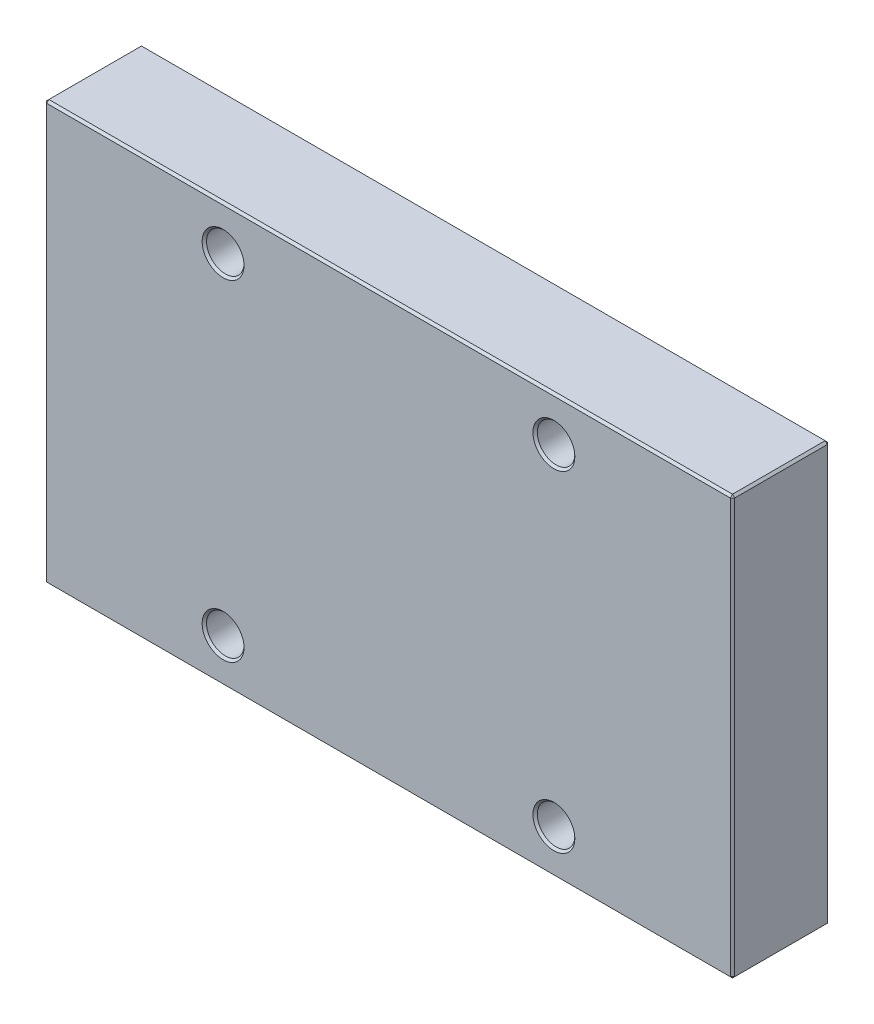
ISO-10303-21;
HEADER;
FILE_DESCRIPTION(('STEP AP214'),'2;1');
FILE_NAME('part.step','',(''),(''),'','','');
FILE_SCHEMA(('AUTOMOTIVE_DESIGN { 1 0 10303 214 1 1 1 1 }'));
ENDSEC;
DATA;
#1=APPLICATION_CONTEXT('core data for automotive mechanical design processes');
#2=APPLICATION_PROTOCOL_DEFINITION('international standard','automotive_design',2000,#1);
#3=PRODUCT_CONTEXT('',#1,'mechanical');
#4=PRODUCT('Part','Part','',(#3));
#5=PRODUCT_RELATED_PRODUCT_CATEGORY('part','',(#4));
#6=PRODUCT_DEFINITION_FORMATION('','',#4);
#7=PRODUCT_DEFINITION_CONTEXT('part definition',#1,'design');
#8=PRODUCT_DEFINITION('design','',#6,#7);
#9=PRODUCT_DEFINITION_SHAPE('','',#8);
#10=(LENGTH_UNIT() NAMED_UNIT(*) SI_UNIT(.MILLI.,.METRE.));
#11=(NAMED_UNIT(*) PLANE_ANGLE_UNIT() SI_UNIT($,.RADIAN.));
#12=(NAMED_UNIT(*) SI_UNIT($,.STERADIAN.) SOLID_ANGLE_UNIT());
#13=UNCERTAINTY_MEASURE_WITH_UNIT(LENGTH_MEASURE(1.E-05),#10,'distance_accuracy_value','');
#14=(GEOMETRIC_REPRESENTATION_CONTEXT(3) GLOBAL_UNCERTAINTY_ASSIGNED_CONTEXT((#13)) GLOBAL_UNIT_ASSIGNED_CONTEXT((#10,
#11,#12)) REPRESENTATION_CONTEXT('',''));
#15=CARTESIAN_POINT('',(0.,0.,0.));
#16=DIRECTION('',(0.,0.,1.));
#17=DIRECTION('',(1.,0.,0.));
#18=AXIS2_PLACEMENT_3D('',#15,#16,#17);
#19=CARTESIAN_POINT('',(-78.,-47.5,-22.));
#20=DIRECTION('',(0.,0.,-1.));
#21=DIRECTION('',(-1.,0.,0.));
#22=AXIS2_PLACEMENT_3D('',#19,#20,#21);
#23=PLANE('',#22);
#24=DIRECTION('',(-1.,0.,0.));
#25=VECTOR('',#24,1.);
#26=CARTESIAN_POINT('',(-78.,-46.9999999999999,-22.));
#27=LINE('',#26,#25);
#28=CARTESIAN_POINT('',(77.5,-47.,-22.));
#29=VERTEX_POINT('',#28);
#30=CARTESIAN_POINT('',(-77.4999999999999,-46.9999999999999,-22.));
#31=VERTEX_POINT('',#30);
#32=EDGE_CURVE('E298',#29,#31,#27,.T.);
#33=ORIENTED_EDGE('',*,*,#32,.T.);
#34=DIRECTION('',(0.,1.,0.));
#35=VECTOR('',#34,1.);
#36=CARTESIAN_POINT('',(-77.4999999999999,-47.5,-22.));
#37=LINE('',#36,#35);
#38=CARTESIAN_POINT('',(-77.4999999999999,47.,-22.));
#39=VERTEX_POINT('',#38);
#40=EDGE_CURVE('E300',#31,#39,#37,.T.);
#41=ORIENTED_EDGE('',*,*,#40,.T.);
#42=DIRECTION('',(1.,0.,0.));
#43=VECTOR('',#42,1.);
#44=CARTESIAN_POINT('',(78.,47.,-22.));
#45=LINE('',#44,#43);
#46=CARTESIAN_POINT('',(77.5,47.,-21.9999999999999));
#47=VERTEX_POINT('',#46);
#48=EDGE_CURVE('E296',#39,#47,#45,.T.);
#49=ORIENTED_EDGE('',*,*,#48,.T.);
#50=DIRECTION('',(0.,-1.,0.));
#51=VECTOR('',#50,1.);
#52=CARTESIAN_POINT('',(77.5,-47.5,-22.));
#53=LINE('',#52,#51);
#54=EDGE_CURVE('E294',#47,#29,#53,.T.);
#55=ORIENTED_EDGE('',*,*,#54,.T.);
#56=EDGE_LOOP('',(#33,#41,#49,#55));
#57=FACE_BOUND('',#56,.T.);
#58=CARTESIAN_POINT('',(37.5,-37.5,-22.));
#59=DIRECTION('',(0.,0.,-1.));
#60=DIRECTION('',(-1.,0.,0.));
#61=AXIS2_PLACEMENT_3D('',#58,#59,#60);
#62=CIRCLE('',#61,7.49999999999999);
#63=CARTESIAN_POINT('',(30.,-37.5,-22.));
#64=VERTEX_POINT('',#63);
#65=EDGE_CURVE('E245',#64,#64,#62,.F.);
#66=ORIENTED_EDGE('',*,*,#65,.T.);
#67=EDGE_LOOP('',(#66));
#68=FACE_BOUND('',#67,.T.);
#69=CARTESIAN_POINT('',(37.5,37.5,-22.));
#70=DIRECTION('',(0.,0.,-1.));
#71=DIRECTION('',(-1.,0.,0.));
#72=AXIS2_PLACEMENT_3D('',#69,#70,#71);
#73=CIRCLE('',#72,7.50000000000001);
#74=CARTESIAN_POINT('',(30.,37.5,-22.));
#75=VERTEX_POINT('',#74);
#76=EDGE_CURVE('E242',#75,#75,#73,.F.);
#77=ORIENTED_EDGE('',*,*,#76,.T.);
#78=EDGE_LOOP('',(#77));
#79=FACE_BOUND('',#78,.T.);
#80=CARTESIAN_POINT('',(-37.5,37.5,-21.9999999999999));
#81=DIRECTION('',(0.,0.,-1.));
#82=DIRECTION('',(-1.,0.,0.));
#83=AXIS2_PLACEMENT_3D('',#80,#81,#82);
#84=CIRCLE('',#83,7.50000000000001);
#85=CARTESIAN_POINT('',(-45.,37.5,-21.9999999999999));
#86=VERTEX_POINT('',#85);
#87=EDGE_CURVE('E239',#86,#86,#84,.F.);
#88=ORIENTED_EDGE('',*,*,#87,.T.);
#89=EDGE_LOOP('',(#88));
#90=FACE_BOUND('',#89,.T.);
#91=CARTESIAN_POINT('',(-37.5,-37.5,-22.));
#92=DIRECTION('',(0.,0.,-1.));
#93=DIRECTION('',(-1.,0.,0.));
#94=AXIS2_PLACEMENT_3D('',#91,#92,#93);
#95=CIRCLE('',#94,7.49999999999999);
#96=CARTESIAN_POINT('',(-45.,-37.5,-22.));
#97=VERTEX_POINT('',#96);
#98=EDGE_CURVE('E236',#97,#97,#95,.F.);
#99=ORIENTED_EDGE('',*,*,#98,.T.);
#100=EDGE_LOOP('',(#99));
#101=FACE_BOUND('',#100,.T.);
#102=ADVANCED_FACE('F34',(#57,#68,#79,#90,#101),#23,.T.);
#103=CARTESIAN_POINT('',(-37.5,-37.5,-22.));
#104=DIRECTION('',(0.,0.,1.));
#105=DIRECTION('',(1.,0.,0.));
#106=AXIS2_PLACEMENT_3D('',#103,#104,#105);
#107=CYLINDRICAL_SURFACE('',#106,4.25000000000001);
#108=CARTESIAN_POINT('',(-37.5,-37.5,-0.5));
#109=DIRECTION('',(0.,0.,-1.));
#110=DIRECTION('',(-1.,0.,0.));
#111=AXIS2_PLACEMENT_3D('',#108,#109,#110);
#112=CIRCLE('',#111,4.25000000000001);
#113=CARTESIAN_POINT('',(-33.25,-37.5,-0.5));
#114=VERTEX_POINT('',#113);
#115=EDGE_CURVE('E143',#114,#114,#112,.F.);
#116=CARTESIAN_POINT('',(-37.5,-37.5,-11.5));
#117=DIRECTION('',(0.,0.,-1.));
#118=DIRECTION('',(-1.,0.,0.));
#119=AXIS2_PLACEMENT_3D('',#116,#117,#118);
#120=CIRCLE('',#119,4.25000000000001);
#121=CARTESIAN_POINT('',(-33.25,-37.5,-11.5));
#122=VERTEX_POINT('',#121);
#123=EDGE_CURVE('E227',#122,#122,#120,.T.);
#124=CARTESIAN_POINT('',(-33.25,-37.5,-0.5));
#125=CARTESIAN_POINT('',(-33.25,-37.5,-0.614583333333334));
#126=CARTESIAN_POINT('',(-33.25,-37.5,-0.729166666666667));
#127=CARTESIAN_POINT('',(-33.25,-37.5,-0.958333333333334));
#128=CARTESIAN_POINT('',(-33.25,-37.5,-1.07291666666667));
#129=CARTESIAN_POINT('',(-33.25,-37.5,-1.30208333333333));
#130=CARTESIAN_POINT('',(-33.25,-37.5,-1.41666666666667));
#131=CARTESIAN_POINT('',(-33.25,-37.5,-1.64583333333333));
#132=CARTESIAN_POINT('',(-33.25,-37.5,-1.76041666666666));
#133=CARTESIAN_POINT('',(-33.25,-37.5,-1.98958333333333));
#134=CARTESIAN_POINT('',(-33.25,-37.5,-2.10416666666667));
#135=CARTESIAN_POINT('',(-33.25,-37.5,-2.33333333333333));
#136=CARTESIAN_POINT('',(-33.25,-37.5,-2.44791666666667));
#137=CARTESIAN_POINT('',(-33.25,-37.5,-2.67708333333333));
#138=CARTESIAN_POINT('',(-33.25,-37.5,-2.79166666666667));
#139=CARTESIAN_POINT('',(-33.25,-37.5,-3.02083333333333));
#140=CARTESIAN_POINT('',(-33.25,-37.5,-3.13541666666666));
#141=CARTESIAN_POINT('',(-33.25,-37.5,-3.36458333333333));
#142=CARTESIAN_POINT('',(-33.25,-37.5,-3.47916666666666));
#143=CARTESIAN_POINT('',(-33.25,-37.5,-3.70833333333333));
#144=CARTESIAN_POINT('',(-33.25,-37.5,-3.82291666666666));
#145=CARTESIAN_POINT('',(-33.25,-37.5,-4.05208333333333));
#146=CARTESIAN_POINT('',(-33.25,-37.5,-4.16666666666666));
#147=CARTESIAN_POINT('',(-33.25,-37.5,-4.39583333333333));
#148=CARTESIAN_POINT('',(-33.25,-37.5,-4.51041666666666));
#149=CARTESIAN_POINT('',(-33.25,-37.5,-4.73958333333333));
#150=CARTESIAN_POINT('',(-33.25,-37.5,-4.85416666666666));
#151=CARTESIAN_POINT('',(-33.25,-37.5,-5.08333333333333));
#152=CARTESIAN_POINT('',(-33.25,-37.5,-5.19791666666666));
#153=CARTESIAN_POINT('',(-33.25,-37.5,-5.42708333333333));
#154=CARTESIAN_POINT('',(-33.25,-37.5,-5.54166666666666));
#155=CARTESIAN_POINT('',(-33.25,-37.5,-5.77083333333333));
#156=CARTESIAN_POINT('',(-33.25,-37.5,-5.88541666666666));
#157=CARTESIAN_POINT('',(-33.25,-37.5,-6.11458333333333));
#158=CARTESIAN_POINT('',(-33.25,-37.5,-6.22916666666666));
#159=CARTESIAN_POINT('',(-33.25,-37.5,-6.45833333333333));
#160=CARTESIAN_POINT('',(-33.25,-37.5,-6.57291666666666));
#161=CARTESIAN_POINT('',(-33.25,-37.5,-6.80208333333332));
#162=CARTESIAN_POINT('',(-33.25,-37.5,-6.91666666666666));
#163=CARTESIAN_POINT('',(-33.25,-37.5,-7.14583333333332));
#164=CARTESIAN_POINT('',(-33.25,-37.5,-7.26041666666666));
#165=CARTESIAN_POINT('',(-33.25,-37.5,-7.48958333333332));
#166=CARTESIAN_POINT('',(-33.25,-37.5,-7.60416666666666));
#167=CARTESIAN_POINT('',(-33.25,-37.5,-7.83333333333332));
#168=CARTESIAN_POINT('',(-33.25,-37.5,-7.94791666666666));
#169=CARTESIAN_POINT('',(-33.25,-37.5,-8.17708333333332));
#170=CARTESIAN_POINT('',(-33.25,-37.5,-8.29166666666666));
#171=CARTESIAN_POINT('',(-33.25,-37.5,-8.52083333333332));
#172=CARTESIAN_POINT('',(-33.25,-37.5,-8.63541666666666));
#173=CARTESIAN_POINT('',(-33.25,-37.5,-8.86458333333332));
#174=CARTESIAN_POINT('',(-33.25,-37.5,-8.97916666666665));
#175=CARTESIAN_POINT('',(-33.25,-37.5,-9.20833333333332));
#176=CARTESIAN_POINT('',(-33.25,-37.5,-9.32291666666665));
#177=CARTESIAN_POINT('',(-33.25,-37.5,-9.55208333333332));
#178=CARTESIAN_POINT('',(-33.25,-37.5,-9.66666666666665));
#179=CARTESIAN_POINT('',(-33.25,-37.5,-9.89583333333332));
#180=CARTESIAN_POINT('',(-33.25,-37.5,-10.0104166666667));
#181=CARTESIAN_POINT('',(-33.25,-37.5,-10.2395833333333));
#182=CARTESIAN_POINT('',(-33.25,-37.5,-10.3541666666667));
#183=CARTESIAN_POINT('',(-33.25,-37.5,-10.5833333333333));
#184=CARTESIAN_POINT('',(-33.25,-37.5,-10.6979166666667));
#185=CARTESIAN_POINT('',(-33.25,-37.5,-10.9270833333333));
#186=CARTESIAN_POINT('',(-33.25,-37.5,-11.0416666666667));
#187=CARTESIAN_POINT('',(-33.25,-37.5,-11.2708333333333));
#188=CARTESIAN_POINT('',(-33.25,-37.5,-11.3854166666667));
#189=CARTESIAN_POINT('',(-33.25,-37.5,-11.5));
#190=B_SPLINE_CURVE_WITH_KNOTS('',3,(#124,#125,#126,#127,#128,#129,#130,#131,#132,#133,#134,
#135,#136,#137,#138,#139,#140,#141,#142,#143,#144,#145,#146,#147,#148,#149,#150,#151,#152,#153,
#154,#155,#156,#157,#158,#159,#160,#161,#162,#163,#164,#165,#166,#167,#168,#169,#170,#171,#172,
#173,#174,#175,#176,#177,#178,#179,#180,#181,#182,#183,#184,#185,#186,#187,#188,#189),
.UNSPECIFIED.,.F.,.F.,(4,2,2,2,2,2,2,2,2,2,2,2,2,2,2,2,2,2,2,2,2,2,2,2,2,2,2,2,2,2,2,2,4),(0.,
0.34375,0.687500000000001,1.03125,1.375,1.71875,2.0625,2.40625,2.75,3.09375,3.4375,3.78125,
4.125,4.46874999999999,4.81249999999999,5.15624999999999,5.49999999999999,5.84374999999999,
6.18749999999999,6.53124999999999,6.87499999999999,7.21874999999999,7.56249999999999,
7.90624999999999,8.24999999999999,8.59374999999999,8.93749999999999,9.28124999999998,
9.62499999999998,9.96874999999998,10.3125,10.65625,11.),.UNSPECIFIED.);
#191=EDGE_CURVE('BSEAM415',#114,#122,#190,.T.);
#192=ORIENTED_EDGE('',*,*,#115,.T.);
#193=ORIENTED_EDGE('',*,*,#123,.T.);
#194=ORIENTED_EDGE('',*,*,#191,.T.);
#195=ORIENTED_EDGE('',*,*,#191,.F.);
#196=EDGE_LOOP('',(#192,#194,#193,#195));
#197=FACE_BOUND('',#196,.T.);
#198=ADVANCED_FACE('F415',(#197),#107,.F.);
#199=CARTESIAN_POINT('',(37.5,37.5,-22.));
#200=DIRECTION('',(0.,0.,1.));
#201=DIRECTION('',(1.,0.,0.));
#202=AXIS2_PLACEMENT_3D('',#199,#200,#201);
#203=CYLINDRICAL_SURFACE('',#202,4.25000000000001);
#204=CARTESIAN_POINT('',(37.5,37.5,-0.499999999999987));
#205=DIRECTION('',(0.,0.,-1.));
#206=DIRECTION('',(-1.,0.,0.));
#207=AXIS2_PLACEMENT_3D('',#204,#205,#206);
#208=CIRCLE('',#207,4.25000000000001);
#209=CARTESIAN_POINT('',(41.75,37.5,-0.499999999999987));
#210=VERTEX_POINT('',#209);
#211=EDGE_CURVE('E275',#210,#210,#208,.F.);
#212=CARTESIAN_POINT('',(37.5,37.5,-11.5));
#213=DIRECTION('',(0.,0.,-1.));
#214=DIRECTION('',(-1.,0.,0.));
#215=AXIS2_PLACEMENT_3D('',#212,#213,#214);
#216=CIRCLE('',#215,4.25000000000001);
#217=CARTESIAN_POINT('',(41.75,37.5,-11.5));
#218=VERTEX_POINT('',#217);
#219=EDGE_CURVE('E215',#218,#218,#216,.T.);
#220=CARTESIAN_POINT('',(41.75,37.5,-0.499999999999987));
#221=CARTESIAN_POINT('',(41.75,37.5,-0.61458333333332));
#222=CARTESIAN_POINT('',(41.75,37.5,-0.729166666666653));
#223=CARTESIAN_POINT('',(41.75,37.5,-0.958333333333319));
#224=CARTESIAN_POINT('',(41.75,37.5,-1.07291666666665));
#225=CARTESIAN_POINT('',(41.75,37.5,-1.30208333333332));
#226=CARTESIAN_POINT('',(41.75,37.5,-1.41666666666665));
#227=CARTESIAN_POINT('',(41.75,37.5,-1.64583333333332));
#228=CARTESIAN_POINT('',(41.75,37.5,-1.76041666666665));
#229=CARTESIAN_POINT('',(41.75,37.5,-1.98958333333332));
#230=CARTESIAN_POINT('',(41.75,37.5,-2.10416666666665));
#231=CARTESIAN_POINT('',(41.75,37.5,-2.33333333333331));
#232=CARTESIAN_POINT('',(41.75,37.5,-2.44791666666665));
#233=CARTESIAN_POINT('',(41.75,37.5,-2.67708333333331));
#234=CARTESIAN_POINT('',(41.75,37.5,-2.79166666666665));
#235=CARTESIAN_POINT('',(41.75,37.5,-3.02083333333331));
#236=CARTESIAN_POINT('',(41.75,37.5,-3.13541666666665));
#237=CARTESIAN_POINT('',(41.75,37.5,-3.36458333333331));
#238=CARTESIAN_POINT('',(41.75,37.5,-3.47916666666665));
#239=CARTESIAN_POINT('',(41.75,37.5,-3.70833333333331));
#240=CARTESIAN_POINT('',(41.75,37.5,-3.82291666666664));
#241=CARTESIAN_POINT('',(41.75,37.5,-4.05208333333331));
#242=CARTESIAN_POINT('',(41.75,37.5,-4.16666666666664));
#243=CARTESIAN_POINT('',(41.75,37.5,-4.39583333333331));
#244=CARTESIAN_POINT('',(41.75,37.5,-4.51041666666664));
#245=CARTESIAN_POINT('',(41.75,37.5,-4.73958333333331));
#246=CARTESIAN_POINT('',(41.75,37.5,-4.85416666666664));
#247=CARTESIAN_POINT('',(41.75,37.5,-5.08333333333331));
#248=CARTESIAN_POINT('',(41.75,37.5,-5.19791666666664));
#249=CARTESIAN_POINT('',(41.75,37.5,-5.42708333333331));
#250=CARTESIAN_POINT('',(41.75,37.5,-5.54166666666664));
#251=CARTESIAN_POINT('',(41.75,37.5,-5.77083333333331));
#252=CARTESIAN_POINT('',(41.75,37.5,-5.88541666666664));
#253=CARTESIAN_POINT('',(41.75,37.5,-6.1145833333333));
#254=CARTESIAN_POINT('',(41.75,37.5,-6.22916666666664));
#255=CARTESIAN_POINT('',(41.75,37.5,-6.4583333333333));
#256=CARTESIAN_POINT('',(41.75,37.5,-6.57291666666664));
#257=CARTESIAN_POINT('',(41.75,37.5,-6.8020833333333));
#258=CARTESIAN_POINT('',(41.75,37.5,-6.91666666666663));
#259=CARTESIAN_POINT('',(41.75,37.5,-7.1458333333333));
#260=CARTESIAN_POINT('',(41.75,37.5,-7.26041666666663));
#261=CARTESIAN_POINT('',(41.75,37.5,-7.4895833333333));
#262=CARTESIAN_POINT('',(41.75,37.5,-7.60416666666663));
#263=CARTESIAN_POINT('',(41.75,37.5,-7.8333333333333));
#264=CARTESIAN_POINT('',(41.75,37.5,-7.94791666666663));
#265=CARTESIAN_POINT('',(41.75,37.5,-8.1770833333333));
#266=CARTESIAN_POINT('',(41.75,37.5,-8.29166666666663));
#267=CARTESIAN_POINT('',(41.75,37.5,-8.5208333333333));
#268=CARTESIAN_POINT('',(41.75,37.5,-8.63541666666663));
#269=CARTESIAN_POINT('',(41.75,37.5,-8.8645833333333));
#270=CARTESIAN_POINT('',(41.75,37.5,-8.97916666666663));
#271=CARTESIAN_POINT('',(41.75,37.5,-9.20833333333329));
#272=CARTESIAN_POINT('',(41.75,37.5,-9.32291666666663));
#273=CARTESIAN_POINT('',(41.75,37.5,-9.55208333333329));
#274=CARTESIAN_POINT('',(41.75,37.5,-9.66666666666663));
#275=CARTESIAN_POINT('',(41.75,37.5,-9.89583333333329));
#276=CARTESIAN_POINT('',(41.75,37.5,-10.0104166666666));
#277=CARTESIAN_POINT('',(41.75,37.5,-10.2395833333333));
#278=CARTESIAN_POINT('',(41.75,37.5,-10.3541666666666));
#279=CARTESIAN_POINT('',(41.75,37.5,-10.5833333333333));
#280=CARTESIAN_POINT('',(41.75,37.5,-10.6979166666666));
#281=CARTESIAN_POINT('',(41.75,37.5,-10.9270833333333));
#282=CARTESIAN_POINT('',(41.75,37.5,-11.0416666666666));
#283=CARTESIAN_POINT('',(41.75,37.5,-11.2708333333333));
#284=CARTESIAN_POINT('',(41.75,37.5,-11.3854166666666));
#285=CARTESIAN_POINT('',(41.75,37.5,-11.5));
#286=B_SPLINE_CURVE_WITH_KNOTS('',3,(#220,#221,#222,#223,#224,#225,#226,#227,#228,#229,#230,
#231,#232,#233,#234,#235,#236,#237,#238,#239,#240,#241,#242,#243,#244,#245,#246,#247,#248,#249,
#250,#251,#252,#253,#254,#255,#256,#257,#258,#259,#260,#261,#262,#263,#264,#265,#266,#267,#268,
#269,#270,#271,#272,#273,#274,#275,#276,#277,#278,#279,#280,#281,#282,#283,#284,#285),
.UNSPECIFIED.,.F.,.F.,(4,2,2,2,2,2,2,2,2,2,2,2,2,2,2,2,2,2,2,2,2,2,2,2,2,2,2,2,2,2,2,2,4),(0.,
0.34375,0.687499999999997,1.03125,1.375,1.71874999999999,2.06249999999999,2.40625,
2.74999999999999,3.09374999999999,3.43749999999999,3.78124999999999,4.12499999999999,
4.46874999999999,4.81249999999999,5.15624999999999,5.49999999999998,5.84374999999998,
6.18749999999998,6.53124999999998,6.87499999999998,7.21874999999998,7.56249999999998,
7.90624999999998,8.24999999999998,8.59374999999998,8.93749999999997,9.28124999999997,
9.62499999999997,9.96874999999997,10.3125,10.65625,11.),.UNSPECIFIED.);
#287=EDGE_CURVE('BSEAM420',#210,#218,#286,.T.);
#288=ORIENTED_EDGE('',*,*,#211,.T.);
#289=ORIENTED_EDGE('',*,*,#219,.T.);
#290=ORIENTED_EDGE('',*,*,#287,.T.);
#291=ORIENTED_EDGE('',*,*,#287,.F.);
#292=EDGE_LOOP('',(#288,#290,#289,#291));
#293=FACE_BOUND('',#292,.T.);
#294=ADVANCED_FACE('F420',(#293),#203,.F.);
#295=CARTESIAN_POINT('',(-77.9999999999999,-47.5,0.));
#296=DIRECTION('',(0.,0.,-1.));
#297=DIRECTION('',(-1.,0.,0.));
#298=AXIS2_PLACEMENT_3D('',#295,#296,#297);
#299=PLANE('',#298);
#300=DIRECTION('',(-1.,0.,0.));
#301=VECTOR('',#300,1.);
#302=CARTESIAN_POINT('',(-78.,47.,0.));
#303=LINE('',#302,#301);
#304=CARTESIAN_POINT('',(77.5,47.,0.));
#305=VERTEX_POINT('',#304);
#306=CARTESIAN_POINT('',(-77.5,47.,0.));
#307=VERTEX_POINT('',#306);
#308=EDGE_CURVE('E132',#305,#307,#303,.T.);
#309=ORIENTED_EDGE('',*,*,#308,.T.);
#310=DIRECTION('',(0.,-1.,0.));
#311=VECTOR('',#310,1.);
#312=CARTESIAN_POINT('',(-77.5,-47.5,0.));
#313=LINE('',#312,#311);
#314=CARTESIAN_POINT('',(-77.4999999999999,-47.,0.));
#315=VERTEX_POINT('',#314);
#316=EDGE_CURVE('E128',#307,#315,#313,.T.);
#317=ORIENTED_EDGE('',*,*,#316,.T.);
#318=DIRECTION('',(1.,0.,0.));
#319=VECTOR('',#318,1.);
#320=CARTESIAN_POINT('',(-78.,-47.,0.));
#321=LINE('',#320,#319);
#322=CARTESIAN_POINT('',(77.5,-47.,0.));
#323=VERTEX_POINT('',#322);
#324=EDGE_CURVE('E121',#315,#323,#321,.T.);
#325=ORIENTED_EDGE('',*,*,#324,.T.);
#326=DIRECTION('',(0.,1.,0.));
#327=VECTOR('',#326,1.);
#328=CARTESIAN_POINT('',(77.5,47.5,0.));
#329=LINE('',#328,#327);
#330=EDGE_CURVE('E125',#323,#305,#329,.T.);
#331=ORIENTED_EDGE('',*,*,#330,.T.);
#332=EDGE_LOOP('',(#309,#317,#325,#331));
#333=FACE_BOUND('',#332,.T.);
#334=CARTESIAN_POINT('',(-37.5,37.5,0.));
#335=DIRECTION('',(0.,0.,-1.));
#336=DIRECTION('',(-1.,0.,0.));
#337=AXIS2_PLACEMENT_3D('',#334,#335,#336);
#338=CIRCLE('',#337,4.75000000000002);
#339=CARTESIAN_POINT('',(-32.75,37.5,0.));
#340=VERTEX_POINT('',#339);
#341=EDGE_CURVE('E269',#340,#340,#338,.T.);
#342=ORIENTED_EDGE('',*,*,#341,.T.);
#343=EDGE_LOOP('',(#342));
#344=FACE_BOUND('',#343,.T.);
#345=CARTESIAN_POINT('',(37.5,37.5,0.));
#346=DIRECTION('',(0.,0.,-1.));
#347=DIRECTION('',(-1.,0.,0.));
#348=AXIS2_PLACEMENT_3D('',#345,#346,#347);
#349=CIRCLE('',#348,4.75000000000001);
#350=CARTESIAN_POINT('',(42.25,37.5,0.));
#351=VERTEX_POINT('',#350);
#352=EDGE_CURVE('E266',#351,#351,#349,.T.);
#353=ORIENTED_EDGE('',*,*,#352,.T.);
#354=EDGE_LOOP('',(#353));
#355=FACE_BOUND('',#354,.T.);
#356=CARTESIAN_POINT('',(37.5,-37.5,0.));
#357=DIRECTION('',(0.,0.,-1.));
#358=DIRECTION('',(-1.,0.,0.));
#359=AXIS2_PLACEMENT_3D('',#356,#357,#358);
#360=CIRCLE('',#359,4.75000000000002);
#361=CARTESIAN_POINT('',(42.25,-37.5,0.));
#362=VERTEX_POINT('',#361);
#363=EDGE_CURVE('E263',#362,#362,#360,.T.);
#364=ORIENTED_EDGE('',*,*,#363,.T.);
#365=EDGE_LOOP('',(#364));
#366=FACE_BOUND('',#365,.T.);
#367=CARTESIAN_POINT('',(-37.5,-37.5,0.));
#368=DIRECTION('',(0.,0.,-1.));
#369=DIRECTION('',(-1.,0.,0.));
#370=AXIS2_PLACEMENT_3D('',#367,#368,#369);
#371=CIRCLE('',#370,4.75000000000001);
#372=CARTESIAN_POINT('',(-32.75,-37.5,0.));
#373=VERTEX_POINT('',#372);
#374=EDGE_CURVE('E260',#373,#373,#371,.T.);
#375=ORIENTED_EDGE('',*,*,#374,.T.);
#376=EDGE_LOOP('',(#375));
#377=FACE_BOUND('',#376,.T.);
#378=ADVANCED_FACE('F123',(#333,#344,#355,#366,#377),#299,.F.);
#379=CARTESIAN_POINT('',(-78.,47.5,-22.));
#380=DIRECTION('',(-1.,0.,0.));
#381=DIRECTION('',(0.,-1.,0.));
#382=AXIS2_PLACEMENT_3D('',#379,#380,#381);
#383=PLANE('',#382);
#384=DIRECTION('',(0.,-1.,0.));
#385=VECTOR('',#384,1.);
#386=CARTESIAN_POINT('',(-77.9999999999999,47.5,-21.5));
#387=LINE('',#386,#385);
#388=CARTESIAN_POINT('',(-78.,47.,-21.5));
#389=VERTEX_POINT('',#388);
#390=CARTESIAN_POINT('',(-78.,-47.,-21.5));
#391=VERTEX_POINT('',#390);
#392=EDGE_CURVE('E287',#389,#391,#387,.T.);
#393=ORIENTED_EDGE('',*,*,#392,.T.);
#394=DIRECTION('',(0.,0.,1.));
#395=VECTOR('',#394,1.);
#396=CARTESIAN_POINT('',(-78.,-47.,0.));
#397=LINE('',#396,#395);
#398=CARTESIAN_POINT('',(-78.,-47.,-0.5));
#399=VERTEX_POINT('',#398);
#400=EDGE_CURVE('E292',#391,#399,#397,.T.);
#401=ORIENTED_EDGE('',*,*,#400,.T.);
#402=DIRECTION('',(0.,1.,0.));
#403=VECTOR('',#402,1.);
#404=CARTESIAN_POINT('',(-78.,47.5,-0.499999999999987));
#405=LINE('',#404,#403);
#406=CARTESIAN_POINT('',(-77.9999999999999,47.,-0.499999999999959));
#407=VERTEX_POINT('',#406);
#408=EDGE_CURVE('E289',#399,#407,#405,.T.);
#409=ORIENTED_EDGE('',*,*,#408,.T.);
#410=DIRECTION('',(0.,0.,-1.));
#411=VECTOR('',#410,1.);
#412=CARTESIAN_POINT('',(-78.,47.,-22.));
#413=LINE('',#412,#411);
#414=EDGE_CURVE('E285',#407,#389,#413,.T.);
#415=ORIENTED_EDGE('',*,*,#414,.T.);
#416=EDGE_LOOP('',(#393,#401,#409,#415));
#417=FACE_BOUND('',#416,.T.);
#418=ADVANCED_FACE('F425',(#417),#383,.T.);
#419=CARTESIAN_POINT('',(-78.,47.5,-22.));
#420=DIRECTION('',(0.,-0.999999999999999,0.));
#421=DIRECTION('',(0.,0.,-1.));
#422=AXIS2_PLACEMENT_3D('',#419,#420,#421);
#423=PLANE('',#422);
#424=DIRECTION('',(0.,0.,1.));
#425=VECTOR('',#424,1.);
#426=CARTESIAN_POINT('',(-77.4999999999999,47.5,0.));
#427=LINE('',#426,#425);
#428=CARTESIAN_POINT('',(-77.4999999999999,47.5,-21.5));
#429=VERTEX_POINT('',#428);
#430=CARTESIAN_POINT('',(-77.4999999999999,47.5,-0.5));
#431=VERTEX_POINT('',#430);
#432=EDGE_CURVE('E315',#429,#431,#427,.T.);
#433=ORIENTED_EDGE('',*,*,#432,.T.);
#434=DIRECTION('',(1.,0.,0.));
#435=VECTOR('',#434,1.);
#436=CARTESIAN_POINT('',(-78.,47.5,-0.499999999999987));
#437=LINE('',#436,#435);
#438=CARTESIAN_POINT('',(77.5,47.5,-0.499999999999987));
#439=VERTEX_POINT('',#438);
#440=EDGE_CURVE('E317',#431,#439,#437,.T.);
#441=ORIENTED_EDGE('',*,*,#440,.T.);
#442=DIRECTION('',(0.,0.,-1.));
#443=VECTOR('',#442,1.);
#444=CARTESIAN_POINT('',(77.5,47.5,-22.));
#445=LINE('',#444,#443);
#446=CARTESIAN_POINT('',(77.5,47.5,-21.5));
#447=VERTEX_POINT('',#446);
#448=EDGE_CURVE('E311',#439,#447,#445,.T.);
#449=ORIENTED_EDGE('',*,*,#448,.T.);
#450=DIRECTION('',(-1.,0.,0.));
#451=VECTOR('',#450,1.);
#452=CARTESIAN_POINT('',(-77.9999999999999,47.5,-21.5));
#453=LINE('',#452,#451);
#454=EDGE_CURVE('E313',#447,#429,#453,.T.);
#455=ORIENTED_EDGE('',*,*,#454,.T.);
#456=EDGE_LOOP('',(#433,#441,#449,#455));
#457=FACE_BOUND('',#456,.T.);
#458=ADVANCED_FACE('F36',(#457),#423,.F.);
#459=CARTESIAN_POINT('',(78.,-47.4999999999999,-22.));
#460=DIRECTION('',(1.,0.,0.));
#461=DIRECTION('',(0.,1.,0.));
#462=AXIS2_PLACEMENT_3D('',#459,#460,#461);
#463=PLANE('',#462);
#464=DIRECTION('',(0.,0.,1.));
#465=VECTOR('',#464,1.);
#466=CARTESIAN_POINT('',(78.,47.,0.));
#467=LINE('',#466,#465);
#468=CARTESIAN_POINT('',(78.,47.,-21.5));
#469=VERTEX_POINT('',#468);
#470=CARTESIAN_POINT('',(78.,47.,-0.5));
#471=VERTEX_POINT('',#470);
#472=EDGE_CURVE('E42',#469,#471,#467,.T.);
#473=ORIENTED_EDGE('',*,*,#472,.T.);
#474=DIRECTION('',(0.,-1.,0.));
#475=VECTOR('',#474,1.);
#476=CARTESIAN_POINT('',(78.,-47.5,-0.5));
#477=LINE('',#476,#475);
#478=CARTESIAN_POINT('',(78.,-47.,-0.5));
#479=VERTEX_POINT('',#478);
#480=EDGE_CURVE('E11',#471,#479,#477,.T.);
#481=ORIENTED_EDGE('',*,*,#480,.T.);
#482=DIRECTION('',(0.,0.,-1.));
#483=VECTOR('',#482,1.);
#484=CARTESIAN_POINT('',(78.,-47.,-22.));
#485=LINE('',#484,#483);
#486=CARTESIAN_POINT('',(78.,-47.,-21.4999999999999));
#487=VERTEX_POINT('',#486);
#488=EDGE_CURVE('E320',#479,#487,#485,.T.);
#489=ORIENTED_EDGE('',*,*,#488,.T.);
#490=DIRECTION('',(0.,1.,0.));
#491=VECTOR('',#490,1.);
#492=CARTESIAN_POINT('',(78.,-47.5,-21.5));
#493=LINE('',#492,#491);
#494=EDGE_CURVE('E52',#487,#469,#493,.T.);
#495=ORIENTED_EDGE('',*,*,#494,.T.);
#496=EDGE_LOOP('',(#473,#481,#489,#495));
#497=FACE_BOUND('',#496,.T.);
#498=ADVANCED_FACE('F322',(#497),#463,.T.);
#499=CARTESIAN_POINT('',(78.,-47.4999999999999,-22.));
#500=DIRECTION('',(0.,1.,0.));
#501=DIRECTION('',(-1.,0.,0.));
#502=AXIS2_PLACEMENT_3D('',#499,#500,#501);
#503=PLANE('',#502);
#504=DIRECTION('',(-1.,0.,0.));
#505=VECTOR('',#504,1.);
#506=CARTESIAN_POINT('',(78.,-47.5,-0.5));
#507=LINE('',#506,#505);
#508=CARTESIAN_POINT('',(77.5,-47.5,-0.5));
#509=VERTEX_POINT('',#508);
#510=CARTESIAN_POINT('',(-77.5,-47.5,-0.5));
#511=VERTEX_POINT('',#510);
#512=EDGE_CURVE('E154',#509,#511,#507,.T.);
#513=ORIENTED_EDGE('',*,*,#512,.T.);
#514=DIRECTION('',(0.,0.,-1.));
#515=VECTOR('',#514,1.);
#516=CARTESIAN_POINT('',(-77.5,-47.5,-22.));
#517=LINE('',#516,#515);
#518=CARTESIAN_POINT('',(-77.5,-47.5,-21.5));
#519=VERTEX_POINT('',#518);
#520=EDGE_CURVE('E308',#511,#519,#517,.T.);
#521=ORIENTED_EDGE('',*,*,#520,.T.);
#522=DIRECTION('',(1.,0.,0.));
#523=VECTOR('',#522,1.);
#524=CARTESIAN_POINT('',(78.,-47.5,-21.5));
#525=LINE('',#524,#523);
#526=CARTESIAN_POINT('',(77.5,-47.5,-21.5));
#527=VERTEX_POINT('',#526);
#528=EDGE_CURVE('E305',#519,#527,#525,.T.);
#529=ORIENTED_EDGE('',*,*,#528,.T.);
#530=DIRECTION('',(0.,0.,1.));
#531=VECTOR('',#530,1.);
#532=CARTESIAN_POINT('',(77.5,-47.5,0.));
#533=LINE('',#532,#531);
#534=EDGE_CURVE('E303',#527,#509,#533,.T.);
#535=ORIENTED_EDGE('',*,*,#534,.T.);
#536=EDGE_LOOP('',(#513,#521,#529,#535));
#537=FACE_BOUND('',#536,.T.);
#538=ADVANCED_FACE('F337',(#537),#503,.F.);
#539=CARTESIAN_POINT('',(-37.5,37.5,-21.9999999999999));
#540=DIRECTION('',(0.,0.,1.));
#541=DIRECTION('',(1.,0.,0.));
#542=AXIS2_PLACEMENT_3D('',#539,#540,#541);
#543=CYLINDRICAL_SURFACE('',#542,4.25000000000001);
#544=CARTESIAN_POINT('',(-37.5,37.5,-0.499999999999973));
#545=DIRECTION('',(0.,0.,-1.));
#546=DIRECTION('',(-1.,0.,0.));
#547=AXIS2_PLACEMENT_3D('',#544,#545,#546);
#548=CIRCLE('',#547,4.25000000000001);
#549=CARTESIAN_POINT('',(-33.25,37.5,-0.499999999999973));
#550=VERTEX_POINT('',#549);
#551=EDGE_CURVE('E272',#550,#550,#548,.F.);
#552=CARTESIAN_POINT('',(-37.5,37.5,-11.5));
#553=DIRECTION('',(0.,0.,1.));
#554=DIRECTION('',(1.,0.,0.));
#555=AXIS2_PLACEMENT_3D('',#552,#553,#554);
#556=CIRCLE('',#555,4.25000000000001);
#557=CARTESIAN_POINT('',(-33.25,37.5,-11.5));
#558=VERTEX_POINT('',#557);
#559=EDGE_CURVE('E221',#558,#558,#556,.F.);
#560=CARTESIAN_POINT('',(-33.25,37.5,-0.499999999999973));
#561=CARTESIAN_POINT('',(-33.25,37.5,-0.614583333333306));
#562=CARTESIAN_POINT('',(-33.25,37.5,-0.72916666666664));
#563=CARTESIAN_POINT('',(-33.25,37.5,-0.958333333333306));
#564=CARTESIAN_POINT('',(-33.25,37.5,-1.07291666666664));
#565=CARTESIAN_POINT('',(-33.25,37.5,-1.30208333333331));
#566=CARTESIAN_POINT('',(-33.25,37.5,-1.41666666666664));
#567=CARTESIAN_POINT('',(-33.25,37.5,-1.6458333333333));
#568=CARTESIAN_POINT('',(-33.25,37.5,-1.76041666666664));
#569=CARTESIAN_POINT('',(-33.25,37.5,-1.9895833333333));
#570=CARTESIAN_POINT('',(-33.25,37.5,-2.10416666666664));
#571=CARTESIAN_POINT('',(-33.25,37.5,-2.3333333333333));
#572=CARTESIAN_POINT('',(-33.25,37.5,-2.44791666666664));
#573=CARTESIAN_POINT('',(-33.25,37.5,-2.6770833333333));
#574=CARTESIAN_POINT('',(-33.25,37.5,-2.79166666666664));
#575=CARTESIAN_POINT('',(-33.25,37.5,-3.0208333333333));
#576=CARTESIAN_POINT('',(-33.25,37.5,-3.13541666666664));
#577=CARTESIAN_POINT('',(-33.25,37.5,-3.3645833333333));
#578=CARTESIAN_POINT('',(-33.25,37.5,-3.47916666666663));
#579=CARTESIAN_POINT('',(-33.25,37.5,-3.7083333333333));
#580=CARTESIAN_POINT('',(-33.25,37.5,-3.82291666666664));
#581=CARTESIAN_POINT('',(-33.25,37.5,-4.0520833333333));
#582=CARTESIAN_POINT('',(-33.25,37.5,-4.16666666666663));
#583=CARTESIAN_POINT('',(-33.25,37.5,-4.3958333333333));
#584=CARTESIAN_POINT('',(-33.25,37.5,-4.51041666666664));
#585=CARTESIAN_POINT('',(-33.25,37.5,-4.7395833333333));
#586=CARTESIAN_POINT('',(-33.25,37.5,-4.85416666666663));
#587=CARTESIAN_POINT('',(-33.25,37.5,-5.0833333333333));
#588=CARTESIAN_POINT('',(-33.25,37.5,-5.19791666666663));
#589=CARTESIAN_POINT('',(-33.25,37.5,-5.4270833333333));
#590=CARTESIAN_POINT('',(-33.25,37.5,-5.54166666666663));
#591=CARTESIAN_POINT('',(-33.25,37.5,-5.7708333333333));
#592=CARTESIAN_POINT('',(-33.25,37.5,-5.88541666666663));
#593=CARTESIAN_POINT('',(-33.25,37.5,-6.1145833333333));
#594=CARTESIAN_POINT('',(-33.25,37.5,-6.22916666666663));
#595=CARTESIAN_POINT('',(-33.25,37.5,-6.4583333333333));
#596=CARTESIAN_POINT('',(-33.25,37.5,-6.57291666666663));
#597=CARTESIAN_POINT('',(-33.25,37.5,-6.8020833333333));
#598=CARTESIAN_POINT('',(-33.25,37.5,-6.91666666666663));
#599=CARTESIAN_POINT('',(-33.25,37.5,-7.1458333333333));
#600=CARTESIAN_POINT('',(-33.25,37.5,-7.26041666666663));
#601=CARTESIAN_POINT('',(-33.25,37.5,-7.48958333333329));
#602=CARTESIAN_POINT('',(-33.25,37.5,-7.60416666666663));
#603=CARTESIAN_POINT('',(-33.25,37.5,-7.83333333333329));
#604=CARTESIAN_POINT('',(-33.25,37.5,-7.94791666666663));
#605=CARTESIAN_POINT('',(-33.25,37.5,-8.17708333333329));
#606=CARTESIAN_POINT('',(-33.25,37.5,-8.29166666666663));
#607=CARTESIAN_POINT('',(-33.25,37.5,-8.52083333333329));
#608=CARTESIAN_POINT('',(-33.25,37.5,-8.63541666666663));
#609=CARTESIAN_POINT('',(-33.25,37.5,-8.86458333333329));
#610=CARTESIAN_POINT('',(-33.25,37.5,-8.97916666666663));
#611=CARTESIAN_POINT('',(-33.25,37.5,-9.20833333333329));
#612=CARTESIAN_POINT('',(-33.25,37.5,-9.32291666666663));
#613=CARTESIAN_POINT('',(-33.25,37.5,-9.55208333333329));
#614=CARTESIAN_POINT('',(-33.25,37.5,-9.66666666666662));
#615=CARTESIAN_POINT('',(-33.25,37.5,-9.89583333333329));
#616=CARTESIAN_POINT('',(-33.25,37.5,-10.0104166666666));
#617=CARTESIAN_POINT('',(-33.25,37.5,-10.2395833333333));
#618=CARTESIAN_POINT('',(-33.25,37.5,-10.3541666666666));
#619=CARTESIAN_POINT('',(-33.25,37.5,-10.5833333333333));
#620=CARTESIAN_POINT('',(-33.25,37.5,-10.6979166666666));
#621=CARTESIAN_POINT('',(-33.25,37.5,-10.9270833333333));
#622=CARTESIAN_POINT('',(-33.25,37.5,-11.0416666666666));
#623=CARTESIAN_POINT('',(-33.25,37.5,-11.2708333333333));
#624=CARTESIAN_POINT('',(-33.25,37.5,-11.3854166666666));
#625=CARTESIAN_POINT('',(-33.25,37.5,-11.5));
#626=B_SPLINE_CURVE_WITH_KNOTS('',3,(#560,#561,#562,#563,#564,#565,#566,#567,#568,#569,#570,
#571,#572,#573,#574,#575,#576,#577,#578,#579,#580,#581,#582,#583,#584,#585,#586,#587,#588,#589,
#590,#591,#592,#593,#594,#595,#596,#597,#598,#599,#600,#601,#602,#603,#604,#605,#606,#607,#608,
#609,#610,#611,#612,#613,#614,#615,#616,#617,#618,#619,#620,#621,#622,#623,#624,#625),
.UNSPECIFIED.,.F.,.F.,(4,2,2,2,2,2,2,2,2,2,2,2,2,2,2,2,2,2,2,2,2,2,2,2,2,2,2,2,2,2,2,2,4),(0.,
0.34375,0.687500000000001,1.03125,1.375,1.71875,2.0625,2.40625,2.75,3.09375,3.4375,3.78125,
4.125,4.46874999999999,4.81249999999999,5.15624999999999,5.49999999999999,5.84374999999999,
6.18749999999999,6.53124999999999,6.87499999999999,7.21874999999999,7.56249999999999,
7.90624999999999,8.24999999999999,8.59374999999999,8.93749999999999,9.28124999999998,
9.62499999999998,9.96874999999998,10.3125,10.65625,11.),.UNSPECIFIED.);
#627=EDGE_CURVE('BSEAM430',#550,#558,#626,.T.);
#628=ORIENTED_EDGE('',*,*,#551,.T.);
#629=ORIENTED_EDGE('',*,*,#559,.T.);
#630=ORIENTED_EDGE('',*,*,#627,.T.);
#631=ORIENTED_EDGE('',*,*,#627,.F.);
#632=EDGE_LOOP('',(#628,#630,#629,#631));
#633=FACE_BOUND('',#632,.T.);
#634=ADVANCED_FACE('F430',(#633),#543,.F.);
#635=CARTESIAN_POINT('',(37.5,-37.5,-22.));
#636=DIRECTION('',(0.,0.,1.));
#637=DIRECTION('',(1.,0.,0.));
#638=AXIS2_PLACEMENT_3D('',#635,#636,#637);
#639=CYLINDRICAL_SURFACE('',#638,4.25000000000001);
#640=CARTESIAN_POINT('',(37.5,-37.5,-0.5));
#641=DIRECTION('',(0.,0.,-1.));
#642=DIRECTION('',(-1.,0.,0.));
#643=AXIS2_PLACEMENT_3D('',#640,#641,#642);
#644=CIRCLE('',#643,4.25000000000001);
#645=CARTESIAN_POINT('',(41.75,-37.5,-0.5));
#646=VERTEX_POINT('',#645);
#647=EDGE_CURVE('E278',#646,#646,#644,.F.);
#648=CARTESIAN_POINT('',(37.5,-37.5,-11.4999999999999));
#649=DIRECTION('',(0.,0.,1.));
#650=DIRECTION('',(1.,0.,0.));
#651=AXIS2_PLACEMENT_3D('',#648,#649,#650);
#652=CIRCLE('',#651,4.25000000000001);
#653=CARTESIAN_POINT('',(41.75,-37.5,-11.4999999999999));
#654=VERTEX_POINT('',#653);
#655=EDGE_CURVE('E233',#654,#654,#652,.F.);
#656=CARTESIAN_POINT('',(41.75,-37.5,-0.5));
#657=CARTESIAN_POINT('',(41.75,-37.5,-0.614583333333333));
#658=CARTESIAN_POINT('',(41.75,-37.5,-0.729166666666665));
#659=CARTESIAN_POINT('',(41.75,-37.5,-0.958333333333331));
#660=CARTESIAN_POINT('',(41.75,-37.5,-1.07291666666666));
#661=CARTESIAN_POINT('',(41.75,-37.5,-1.30208333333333));
#662=CARTESIAN_POINT('',(41.75,-37.5,-1.41666666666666));
#663=CARTESIAN_POINT('',(41.75,-37.5,-1.64583333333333));
#664=CARTESIAN_POINT('',(41.75,-37.5,-1.76041666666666));
#665=CARTESIAN_POINT('',(41.75,-37.5,-1.98958333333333));
#666=CARTESIAN_POINT('',(41.75,-37.5,-2.10416666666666));
#667=CARTESIAN_POINT('',(41.75,-37.5,-2.33333333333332));
#668=CARTESIAN_POINT('',(41.75,-37.5,-2.44791666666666));
#669=CARTESIAN_POINT('',(41.75,-37.5,-2.67708333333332));
#670=CARTESIAN_POINT('',(41.75,-37.5,-2.79166666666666));
#671=CARTESIAN_POINT('',(41.75,-37.5,-3.02083333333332));
#672=CARTESIAN_POINT('',(41.75,-37.5,-3.13541666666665));
#673=CARTESIAN_POINT('',(41.75,-37.5,-3.36458333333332));
#674=CARTESIAN_POINT('',(41.75,-37.5,-3.47916666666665));
#675=CARTESIAN_POINT('',(41.75,-37.5,-3.70833333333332));
#676=CARTESIAN_POINT('',(41.75,-37.5,-3.82291666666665));
#677=CARTESIAN_POINT('',(41.75,-37.5,-4.05208333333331));
#678=CARTESIAN_POINT('',(41.75,-37.5,-4.16666666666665));
#679=CARTESIAN_POINT('',(41.75,-37.5,-4.39583333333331));
#680=CARTESIAN_POINT('',(41.75,-37.5,-4.51041666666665));
#681=CARTESIAN_POINT('',(41.75,-37.5,-4.73958333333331));
#682=CARTESIAN_POINT('',(41.75,-37.5,-4.85416666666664));
#683=CARTESIAN_POINT('',(41.75,-37.5,-5.08333333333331));
#684=CARTESIAN_POINT('',(41.75,-37.5,-5.19791666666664));
#685=CARTESIAN_POINT('',(41.75,-37.5,-5.42708333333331));
#686=CARTESIAN_POINT('',(41.75,-37.5,-5.54166666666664));
#687=CARTESIAN_POINT('',(41.75,-37.5,-5.77083333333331));
#688=CARTESIAN_POINT('',(41.75,-37.5,-5.88541666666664));
#689=CARTESIAN_POINT('',(41.75,-37.5,-6.1145833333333));
#690=CARTESIAN_POINT('',(41.75,-37.5,-6.22916666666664));
#691=CARTESIAN_POINT('',(41.75,-37.5,-6.4583333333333));
#692=CARTESIAN_POINT('',(41.75,-37.5,-6.57291666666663));
#693=CARTESIAN_POINT('',(41.75,-37.5,-6.8020833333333));
#694=CARTESIAN_POINT('',(41.75,-37.5,-6.91666666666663));
#695=CARTESIAN_POINT('',(41.75,-37.5,-7.1458333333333));
#696=CARTESIAN_POINT('',(41.75,-37.5,-7.26041666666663));
#697=CARTESIAN_POINT('',(41.75,-37.5,-7.4895833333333));
#698=CARTESIAN_POINT('',(41.75,-37.5,-7.60416666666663));
#699=CARTESIAN_POINT('',(41.75,-37.5,-7.83333333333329));
#700=CARTESIAN_POINT('',(41.75,-37.5,-7.94791666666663));
#701=CARTESIAN_POINT('',(41.75,-37.5,-8.17708333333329));
#702=CARTESIAN_POINT('',(41.75,-37.5,-8.29166666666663));
#703=CARTESIAN_POINT('',(41.75,-37.5,-8.52083333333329));
#704=CARTESIAN_POINT('',(41.75,-37.5,-8.63541666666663));
#705=CARTESIAN_POINT('',(41.75,-37.5,-8.86458333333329));
#706=CARTESIAN_POINT('',(41.75,-37.5,-8.97916666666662));
#707=CARTESIAN_POINT('',(41.75,-37.5,-9.20833333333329));
#708=CARTESIAN_POINT('',(41.75,-37.5,-9.32291666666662));
#709=CARTESIAN_POINT('',(41.75,-37.5,-9.55208333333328));
#710=CARTESIAN_POINT('',(41.75,-37.5,-9.66666666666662));
#711=CARTESIAN_POINT('',(41.75,-37.5,-9.89583333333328));
#712=CARTESIAN_POINT('',(41.75,-37.5,-10.0104166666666));
#713=CARTESIAN_POINT('',(41.75,-37.5,-10.2395833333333));
#714=CARTESIAN_POINT('',(41.75,-37.5,-10.3541666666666));
#715=CARTESIAN_POINT('',(41.75,-37.5,-10.5833333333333));
#716=CARTESIAN_POINT('',(41.75,-37.5,-10.6979166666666));
#717=CARTESIAN_POINT('',(41.75,-37.5,-10.9270833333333));
#718=CARTESIAN_POINT('',(41.75,-37.5,-11.0416666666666));
#719=CARTESIAN_POINT('',(41.75,-37.5,-11.2708333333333));
#720=CARTESIAN_POINT('',(41.75,-37.5,-11.3854166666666));
#721=CARTESIAN_POINT('',(41.75,-37.5,-11.4999999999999));
#722=B_SPLINE_CURVE_WITH_KNOTS('',3,(#656,#657,#658,#659,#660,#661,#662,#663,#664,#665,#666,
#667,#668,#669,#670,#671,#672,#673,#674,#675,#676,#677,#678,#679,#680,#681,#682,#683,#684,#685,
#686,#687,#688,#689,#690,#691,#692,#693,#694,#695,#696,#697,#698,#699,#700,#701,#702,#703,#704,
#705,#706,#707,#708,#709,#710,#711,#712,#713,#714,#715,#716,#717,#718,#719,#720,#721),
.UNSPECIFIED.,.F.,.F.,(4,2,2,2,2,2,2,2,2,2,2,2,2,2,2,2,2,2,2,2,2,2,2,2,2,2,2,2,2,2,2,2,4),(0.,
0.343749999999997,0.687499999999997,1.03124999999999,1.37499999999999,1.71874999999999,
2.06249999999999,2.40624999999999,2.74999999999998,3.09374999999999,3.43749999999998,
3.78124999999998,4.12499999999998,4.46874999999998,4.81249999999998,5.15624999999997,
5.49999999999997,5.84374999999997,6.18749999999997,6.53124999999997,6.87499999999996,
7.21874999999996,7.56249999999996,7.90624999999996,8.24999999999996,8.59374999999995,
8.93749999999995,9.28124999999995,9.62499999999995,9.96874999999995,10.3124999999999,
10.6562499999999,10.9999999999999),.UNSPECIFIED.);
#723=EDGE_CURVE('BSEAM541',#646,#654,#722,.T.);
#724=ORIENTED_EDGE('',*,*,#647,.T.);
#725=ORIENTED_EDGE('',*,*,#655,.T.);
#726=ORIENTED_EDGE('',*,*,#723,.T.);
#727=ORIENTED_EDGE('',*,*,#723,.F.);
#728=EDGE_LOOP('',(#724,#726,#725,#727));
#729=FACE_BOUND('',#728,.T.);
#730=ADVANCED_FACE('F541',(#729),#639,.F.);
#731=CARTESIAN_POINT('',(37.5,37.5,-12.));
#732=DIRECTION('',(0.,0.,-1.));
#733=DIRECTION('',(-1.,0.,0.));
#734=AXIS2_PLACEMENT_3D('',#731,#732,#733);
#735=PLANE('',#734);
#736=CARTESIAN_POINT('',(37.5,37.5,-12.));
#737=DIRECTION('',(0.,0.,-1.));
#738=DIRECTION('',(-1.,0.,0.));
#739=AXIS2_PLACEMENT_3D('',#736,#737,#738);
#740=CIRCLE('',#739,4.75000000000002);
#741=CARTESIAN_POINT('',(32.75,37.5,-12.));
#742=VERTEX_POINT('',#741);
#743=EDGE_CURVE('E212',#742,#742,#740,.F.);
#744=ORIENTED_EDGE('',*,*,#743,.T.);
#745=EDGE_LOOP('',(#744));
#746=FACE_BOUND('',#745,.T.);
#747=CARTESIAN_POINT('',(37.5,37.5,-12.));
#748=DIRECTION('',(0.,0.,-1.));
#749=DIRECTION('',(-1.,0.,0.));
#750=AXIS2_PLACEMENT_3D('',#747,#748,#749);
#751=CIRCLE('',#750,7.);
#752=CARTESIAN_POINT('',(30.5,37.5,-12.));
#753=VERTEX_POINT('',#752);
#754=EDGE_CURVE('E209',#753,#753,#751,.T.);
#755=ORIENTED_EDGE('',*,*,#754,.T.);
#756=EDGE_LOOP('',(#755));
#757=FACE_BOUND('',#756,.T.);
#758=ADVANCED_FACE('F538',(#746,#757),#735,.T.);
#759=CARTESIAN_POINT('',(37.5,37.5,-12.));
#760=DIRECTION('',(0.,0.,-1.));
#761=DIRECTION('',(-1.,0.,0.));
#762=AXIS2_PLACEMENT_3D('',#759,#760,#761);
#763=CYLINDRICAL_SURFACE('',#762,7.);
#764=CARTESIAN_POINT('',(37.5,37.5,-21.5));
#765=DIRECTION('',(0.,0.,-1.));
#766=DIRECTION('',(-1.,0.,0.));
#767=AXIS2_PLACEMENT_3D('',#764,#765,#766);
#768=CIRCLE('',#767,7.);
#769=CARTESIAN_POINT('',(30.5,37.5,-21.5));
#770=VERTEX_POINT('',#769);
#771=EDGE_CURVE('E251',#770,#770,#768,.T.);
#772=CARTESIAN_POINT('',(30.5,37.5,-21.5));
#773=CARTESIAN_POINT('',(30.5,37.5,-21.4010416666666));
#774=CARTESIAN_POINT('',(30.5,37.5,-21.3020833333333));
#775=CARTESIAN_POINT('',(30.5,37.5,-21.1041666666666));
#776=CARTESIAN_POINT('',(30.5,37.5,-21.0052083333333));
#777=CARTESIAN_POINT('',(30.5,37.5,-20.8072916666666));
#778=CARTESIAN_POINT('',(30.5,37.5,-20.7083333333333));
#779=CARTESIAN_POINT('',(30.5,37.5,-20.5104166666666));
#780=CARTESIAN_POINT('',(30.5,37.5,-20.4114583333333));
#781=CARTESIAN_POINT('',(30.5,37.5,-20.2135416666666));
#782=CARTESIAN_POINT('',(30.5,37.5,-20.1145833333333));
#783=CARTESIAN_POINT('',(30.5,37.5,-19.9166666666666));
#784=CARTESIAN_POINT('',(30.5,37.5,-19.8177083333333));
#785=CARTESIAN_POINT('',(30.5,37.5,-19.6197916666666));
#786=CARTESIAN_POINT('',(30.5,37.5,-19.5208333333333));
#787=CARTESIAN_POINT('',(30.5,37.5,-19.3229166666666));
#788=CARTESIAN_POINT('',(30.5,37.5,-19.2239583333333));
#789=CARTESIAN_POINT('',(30.5,37.5,-19.0260416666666));
#790=CARTESIAN_POINT('',(30.5,37.5,-18.9270833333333));
#791=CARTESIAN_POINT('',(30.5,37.5,-18.7291666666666));
#792=CARTESIAN_POINT('',(30.5,37.5,-18.6302083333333));
#793=CARTESIAN_POINT('',(30.5,37.5,-18.4322916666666));
#794=CARTESIAN_POINT('',(30.5,37.5,-18.3333333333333));
#795=CARTESIAN_POINT('',(30.5,37.5,-18.1354166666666));
#796=CARTESIAN_POINT('',(30.5,37.5,-18.0364583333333));
#797=CARTESIAN_POINT('',(30.5,37.5,-17.8385416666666));
#798=CARTESIAN_POINT('',(30.5,37.5,-17.7395833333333));
#799=CARTESIAN_POINT('',(30.5,37.5,-17.5416666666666));
#800=CARTESIAN_POINT('',(30.5,37.5,-17.4427083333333));
#801=CARTESIAN_POINT('',(30.5,37.5,-17.2447916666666));
#802=CARTESIAN_POINT('',(30.5,37.5,-17.1458333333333));
#803=CARTESIAN_POINT('',(30.5,37.5,-16.9479166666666));
#804=CARTESIAN_POINT('',(30.5,37.5,-16.8489583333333));
#805=CARTESIAN_POINT('',(30.5,37.5,-16.6510416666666));
#806=CARTESIAN_POINT('',(30.5,37.5,-16.5520833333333));
#807=CARTESIAN_POINT('',(30.5,37.5,-16.3541666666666));
#808=CARTESIAN_POINT('',(30.5,37.5,-16.2552083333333));
#809=CARTESIAN_POINT('',(30.5,37.5,-16.0572916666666));
#810=CARTESIAN_POINT('',(30.5,37.5,-15.9583333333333));
#811=CARTESIAN_POINT('',(30.5,37.5,-15.7604166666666));
#812=CARTESIAN_POINT('',(30.5,37.5,-15.6614583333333));
#813=CARTESIAN_POINT('',(30.5,37.5,-15.4635416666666));
#814=CARTESIAN_POINT('',(30.5,37.5,-15.3645833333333));
#815=CARTESIAN_POINT('',(30.5,37.5,-15.1666666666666));
#816=CARTESIAN_POINT('',(30.5,37.5,-15.0677083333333));
#817=CARTESIAN_POINT('',(30.5,37.5,-14.8697916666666));
#818=CARTESIAN_POINT('',(30.5,37.5,-14.7708333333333));
#819=CARTESIAN_POINT('',(30.5,37.5,-14.5729166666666));
#820=CARTESIAN_POINT('',(30.5,37.5,-14.4739583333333));
#821=CARTESIAN_POINT('',(30.5,37.5,-14.2760416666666));
#822=CARTESIAN_POINT('',(30.5,37.5,-14.1770833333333));
#823=CARTESIAN_POINT('',(30.5,37.5,-13.9791666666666));
#824=CARTESIAN_POINT('',(30.5,37.5,-13.8802083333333));
#825=CARTESIAN_POINT('',(30.5,37.5,-13.6822916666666));
#826=CARTESIAN_POINT('',(30.5,37.5,-13.5833333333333));
#827=CARTESIAN_POINT('',(30.5,37.5,-13.3854166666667));
#828=CARTESIAN_POINT('',(30.5,37.5,-13.2864583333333));
#829=CARTESIAN_POINT('',(30.5,37.5,-13.0885416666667));
#830=CARTESIAN_POINT('',(30.5,37.5,-12.9895833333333));
#831=CARTESIAN_POINT('',(30.5,37.5,-12.7916666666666));
#832=CARTESIAN_POINT('',(30.5,37.5,-12.6927083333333));
#833=CARTESIAN_POINT('',(30.5,37.5,-12.4947916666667));
#834=CARTESIAN_POINT('',(30.5,37.5,-12.3958333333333));
#835=CARTESIAN_POINT('',(30.5,37.5,-12.1979166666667));
#836=CARTESIAN_POINT('',(30.5,37.5,-12.0989583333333));
#837=CARTESIAN_POINT('',(30.5,37.5,-12.));
#838=B_SPLINE_CURVE_WITH_KNOTS('',3,(#772,#773,#774,#775,#776,#777,#778,#779,#780,#781,#782,
#783,#784,#785,#786,#787,#788,#789,#790,#791,#792,#793,#794,#795,#796,#797,#798,#799,#800,#801,
#802,#803,#804,#805,#806,#807,#808,#809,#810,#811,#812,#813,#814,#815,#816,#817,#818,#819,#820,
#821,#822,#823,#824,#825,#826,#827,#828,#829,#830,#831,#832,#833,#834,#835,#836,#837),
.UNSPECIFIED.,.F.,.F.,(4,2,2,2,2,2,2,2,2,2,2,2,2,2,2,2,2,2,2,2,2,2,2,2,2,2,2,2,2,2,2,2,4),(0.,
0.296874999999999,0.593750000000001,0.890624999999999,1.1875,1.484375,1.78125,2.078125,2.375,
2.671875,2.96875,3.265625,3.5625,3.85937499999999,4.15625,4.453125,4.74999999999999,5.046875,
5.34374999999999,5.64062499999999,5.93749999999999,6.234375,6.53124999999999,6.82812499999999,
7.12499999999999,7.42187499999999,7.71874999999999,8.01562499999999,8.31249999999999,
8.60937499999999,8.90624999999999,9.20312499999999,9.49999999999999),.UNSPECIFIED.);
#839=EDGE_CURVE('BSEAM534',#770,#753,#838,.T.);
#840=ORIENTED_EDGE('',*,*,#771,.T.);
#841=ORIENTED_EDGE('',*,*,#754,.F.);
#842=ORIENTED_EDGE('',*,*,#839,.T.);
#843=ORIENTED_EDGE('',*,*,#839,.F.);
#844=EDGE_LOOP('',(#840,#842,#841,#843));
#845=FACE_BOUND('',#844,.T.);
#846=ADVANCED_FACE('F534',(#845),#763,.F.);
#847=CARTESIAN_POINT('',(37.5,-37.5,-12.));
#848=DIRECTION('',(0.,0.,-1.));
#849=DIRECTION('',(-1.,0.,0.));
#850=AXIS2_PLACEMENT_3D('',#847,#848,#849);
#851=CYLINDRICAL_SURFACE('',#850,6.99999999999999);
#852=CARTESIAN_POINT('',(37.5,-37.5,-21.5));
#853=DIRECTION('',(0.,0.,-1.));
#854=DIRECTION('',(-1.,0.,0.));
#855=AXIS2_PLACEMENT_3D('',#852,#853,#854);
#856=CIRCLE('',#855,6.99999999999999);
#857=CARTESIAN_POINT('',(30.5,-37.5,-21.5));
#858=VERTEX_POINT('',#857);
#859=EDGE_CURVE('E248',#858,#858,#856,.T.);
#860=CARTESIAN_POINT('',(37.5,-37.5,-12.));
#861=DIRECTION('',(0.,0.,1.));
#862=DIRECTION('',(1.,0.,0.));
#863=AXIS2_PLACEMENT_3D('',#860,#861,#862);
#864=CIRCLE('',#863,6.99999999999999);
#865=CARTESIAN_POINT('',(30.5,-37.5,-12.));
#866=VERTEX_POINT('',#865);
#867=EDGE_CURVE('E206',#866,#866,#864,.T.);
#868=CARTESIAN_POINT('',(30.5,-37.5,-21.5));
#869=CARTESIAN_POINT('',(30.5,-37.5,-21.4010416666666));
#870=CARTESIAN_POINT('',(30.5,-37.5,-21.3020833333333));
#871=CARTESIAN_POINT('',(30.5,-37.5,-21.1041666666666));
#872=CARTESIAN_POINT('',(30.5,-37.5,-21.0052083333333));
#873=CARTESIAN_POINT('',(30.5,-37.5,-20.8072916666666));
#874=CARTESIAN_POINT('',(30.5,-37.5,-20.7083333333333));
#875=CARTESIAN_POINT('',(30.5,-37.5,-20.5104166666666));
#876=CARTESIAN_POINT('',(30.5,-37.5,-20.4114583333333));
#877=CARTESIAN_POINT('',(30.5,-37.5,-20.2135416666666));
#878=CARTESIAN_POINT('',(30.5,-37.5,-20.1145833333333));
#879=CARTESIAN_POINT('',(30.5,-37.5,-19.9166666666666));
#880=CARTESIAN_POINT('',(30.5,-37.5,-19.8177083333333));
#881=CARTESIAN_POINT('',(30.5,-37.5,-19.6197916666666));
#882=CARTESIAN_POINT('',(30.5,-37.5,-19.5208333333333));
#883=CARTESIAN_POINT('',(30.5,-37.5,-19.3229166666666));
#884=CARTESIAN_POINT('',(30.5,-37.5,-19.2239583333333));
#885=CARTESIAN_POINT('',(30.5,-37.5,-19.0260416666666));
#886=CARTESIAN_POINT('',(30.5,-37.5,-18.9270833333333));
#887=CARTESIAN_POINT('',(30.5,-37.5,-18.7291666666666));
#888=CARTESIAN_POINT('',(30.5,-37.5,-18.6302083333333));
#889=CARTESIAN_POINT('',(30.5,-37.5,-18.4322916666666));
#890=CARTESIAN_POINT('',(30.5,-37.5,-18.3333333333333));
#891=CARTESIAN_POINT('',(30.5,-37.5,-18.1354166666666));
#892=CARTESIAN_POINT('',(30.5,-37.5,-18.0364583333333));
#893=CARTESIAN_POINT('',(30.5,-37.5,-17.8385416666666));
#894=CARTESIAN_POINT('',(30.5,-37.5,-17.7395833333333));
#895=CARTESIAN_POINT('',(30.5,-37.5,-17.5416666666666));
#896=CARTESIAN_POINT('',(30.5,-37.5,-17.4427083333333));
#897=CARTESIAN_POINT('',(30.5,-37.5,-17.2447916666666));
#898=CARTESIAN_POINT('',(30.5,-37.5,-17.1458333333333));
#899=CARTESIAN_POINT('',(30.5,-37.5,-16.9479166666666));
#900=CARTESIAN_POINT('',(30.5,-37.5,-16.8489583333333));
#901=CARTESIAN_POINT('',(30.5,-37.5,-16.6510416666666));
#902=CARTESIAN_POINT('',(30.5,-37.5,-16.5520833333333));
#903=CARTESIAN_POINT('',(30.5,-37.5,-16.3541666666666));
#904=CARTESIAN_POINT('',(30.5,-37.5,-16.2552083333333));
#905=CARTESIAN_POINT('',(30.5,-37.5,-16.0572916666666));
#906=CARTESIAN_POINT('',(30.5,-37.5,-15.9583333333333));
#907=CARTESIAN_POINT('',(30.5,-37.5,-15.7604166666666));
#908=CARTESIAN_POINT('',(30.5,-37.5,-15.6614583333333));
#909=CARTESIAN_POINT('',(30.5,-37.5,-15.4635416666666));
#910=CARTESIAN_POINT('',(30.5,-37.5,-15.3645833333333));
#911=CARTESIAN_POINT('',(30.5,-37.5,-15.1666666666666));
#912=CARTESIAN_POINT('',(30.5,-37.5,-15.0677083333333));
#913=CARTESIAN_POINT('',(30.5,-37.5,-14.8697916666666));
#914=CARTESIAN_POINT('',(30.5,-37.5,-14.7708333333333));
#915=CARTESIAN_POINT('',(30.5,-37.5,-14.5729166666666));
#916=CARTESIAN_POINT('',(30.5,-37.5,-14.4739583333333));
#917=CARTESIAN_POINT('',(30.5,-37.5,-14.2760416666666));
#918=CARTESIAN_POINT('',(30.5,-37.5,-14.1770833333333));
#919=CARTESIAN_POINT('',(30.5,-37.5,-13.9791666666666));
#920=CARTESIAN_POINT('',(30.5,-37.5,-13.8802083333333));
#921=CARTESIAN_POINT('',(30.5,-37.5,-13.6822916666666));
#922=CARTESIAN_POINT('',(30.5,-37.5,-13.5833333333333));
#923=CARTESIAN_POINT('',(30.5,-37.5,-13.3854166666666));
#924=CARTESIAN_POINT('',(30.5,-37.5,-13.2864583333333));
#925=CARTESIAN_POINT('',(30.5,-37.5,-13.0885416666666));
#926=CARTESIAN_POINT('',(30.5,-37.5,-12.9895833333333));
#927=CARTESIAN_POINT('',(30.5,-37.5,-12.7916666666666));
#928=CARTESIAN_POINT('',(30.5,-37.5,-12.6927083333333));
#929=CARTESIAN_POINT('',(30.5,-37.5,-12.4947916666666));
#930=CARTESIAN_POINT('',(30.5,-37.5,-12.3958333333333));
#931=CARTESIAN_POINT('',(30.5,-37.5,-12.1979166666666));
#932=CARTESIAN_POINT('',(30.5,-37.5,-12.0989583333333));
#933=CARTESIAN_POINT('',(30.5,-37.5,-12.));
#934=B_SPLINE_CURVE_WITH_KNOTS('',3,(#868,#869,#870,#871,#872,#873,#874,#875,#876,#877,#878,
#879,#880,#881,#882,#883,#884,#885,#886,#887,#888,#889,#890,#891,#892,#893,#894,#895,#896,#897,
#898,#899,#900,#901,#902,#903,#904,#905,#906,#907,#908,#909,#910,#911,#912,#913,#914,#915,#916,
#917,#918,#919,#920,#921,#922,#923,#924,#925,#926,#927,#928,#929,#930,#931,#932,#933),
.UNSPECIFIED.,.F.,.F.,(4,2,2,2,2,2,2,2,2,2,2,2,2,2,2,2,2,2,2,2,2,2,2,2,2,2,2,2,2,2,2,2,4),(0.,
0.296874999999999,0.593750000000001,0.890625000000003,1.1875,1.484375,1.78125,2.078125,2.375,
2.671875,2.96875,3.265625,3.5625,3.859375,4.15625,4.453125,4.75,5.046875,5.34375,5.640625,
5.9375,6.234375,6.53125,6.828125,7.125,7.421875,7.71875,8.015625,8.3125,8.609375,8.90625,
9.20312500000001,9.50000000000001),.UNSPECIFIED.);
#935=EDGE_CURVE('BSEAM527',#858,#866,#934,.T.);
#936=ORIENTED_EDGE('',*,*,#859,.T.);
#937=ORIENTED_EDGE('',*,*,#867,.T.);
#938=ORIENTED_EDGE('',*,*,#935,.T.);
#939=ORIENTED_EDGE('',*,*,#935,.F.);
#940=EDGE_LOOP('',(#936,#938,#937,#939));
#941=FACE_BOUND('',#940,.T.);
#942=ADVANCED_FACE('F527',(#941),#851,.F.);
#943=CARTESIAN_POINT('',(37.5,-37.5,-12.));
#944=DIRECTION('',(0.,0.,1.));
#945=DIRECTION('',(1.,0.,0.));
#946=AXIS2_PLACEMENT_3D('',#943,#944,#945);
#947=PLANE('',#946);
#948=CARTESIAN_POINT('',(37.5,-37.5,-12.));
#949=DIRECTION('',(0.,0.,1.));
#950=DIRECTION('',(1.,0.,0.));
#951=AXIS2_PLACEMENT_3D('',#948,#949,#950);
#952=CIRCLE('',#951,4.75000000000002);
#953=CARTESIAN_POINT('',(42.25,-37.5,-12.));
#954=VERTEX_POINT('',#953);
#955=EDGE_CURVE('E230',#954,#954,#952,.T.);
#956=ORIENTED_EDGE('',*,*,#955,.T.);
#957=EDGE_LOOP('',(#956));
#958=FACE_BOUND('',#957,.T.);
#959=ORIENTED_EDGE('',*,*,#867,.F.);
#960=EDGE_LOOP('',(#959));
#961=FACE_BOUND('',#960,.T.);
#962=ADVANCED_FACE('F525',(#958,#961),#947,.F.);
#963=CARTESIAN_POINT('',(-37.5,-37.5,-12.));
#964=DIRECTION('',(0.,0.,-1.));
#965=DIRECTION('',(-1.,0.,0.));
#966=AXIS2_PLACEMENT_3D('',#963,#964,#965);
#967=PLANE('',#966);
#968=CARTESIAN_POINT('',(-37.5,-37.5,-12.));
#969=DIRECTION('',(0.,0.,-1.));
#970=DIRECTION('',(-1.,0.,0.));
#971=AXIS2_PLACEMENT_3D('',#968,#969,#970);
#972=CIRCLE('',#971,4.75000000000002);
#973=CARTESIAN_POINT('',(-42.25,-37.5,-12.));
#974=VERTEX_POINT('',#973);
#975=EDGE_CURVE('E224',#974,#974,#972,.F.);
#976=ORIENTED_EDGE('',*,*,#975,.T.);
#977=EDGE_LOOP('',(#976));
#978=FACE_BOUND('',#977,.T.);
#979=CARTESIAN_POINT('',(-37.5,-37.5,-12.));
#980=DIRECTION('',(0.,0.,-1.));
#981=DIRECTION('',(-1.,0.,0.));
#982=AXIS2_PLACEMENT_3D('',#979,#980,#981);
#983=CIRCLE('',#982,6.99999999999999);
#984=CARTESIAN_POINT('',(-44.4999999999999,-37.5,-12.));
#985=VERTEX_POINT('',#984);
#986=EDGE_CURVE('E203',#985,#985,#983,.T.);
#987=ORIENTED_EDGE('',*,*,#986,.T.);
#988=EDGE_LOOP('',(#987));
#989=FACE_BOUND('',#988,.T.);
#990=ADVANCED_FACE('F522',(#978,#989),#967,.T.);
#991=CARTESIAN_POINT('',(-37.5,-37.5,-12.));
#992=DIRECTION('',(0.,0.,-1.));
#993=DIRECTION('',(-1.,0.,0.));
#994=AXIS2_PLACEMENT_3D('',#991,#992,#993);
#995=CYLINDRICAL_SURFACE('',#994,6.99999999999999);
#996=CARTESIAN_POINT('',(-37.5,-37.5,-21.5));
#997=DIRECTION('',(0.,0.,-1.));
#998=DIRECTION('',(-1.,0.,0.));
#999=AXIS2_PLACEMENT_3D('',#996,#997,#998);
#1000=CIRCLE('',#999,6.99999999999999);
#1001=CARTESIAN_POINT('',(-44.4999999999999,-37.5,-21.5));
#1002=VERTEX_POINT('',#1001);
#1003=EDGE_CURVE('E257',#1002,#1002,#1000,.T.);
#1004=CARTESIAN_POINT('',(-44.4999999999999,-37.5,-21.5));
#1005=CARTESIAN_POINT('',(-44.4999999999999,-37.5,-21.4010416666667));
#1006=CARTESIAN_POINT('',(-44.4999999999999,-37.5,-21.3020833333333));
#1007=CARTESIAN_POINT('',(-44.4999999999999,-37.5,-21.1041666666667));
#1008=CARTESIAN_POINT('',(-44.4999999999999,-37.5,-21.0052083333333));
#1009=CARTESIAN_POINT('',(-44.4999999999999,-37.5,-20.8072916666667));
#1010=CARTESIAN_POINT('',(-44.4999999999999,-37.5,-20.7083333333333));
#1011=CARTESIAN_POINT('',(-44.4999999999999,-37.5,-20.5104166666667));
#1012=CARTESIAN_POINT('',(-44.4999999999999,-37.5,-20.4114583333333));
#1013=CARTESIAN_POINT('',(-44.4999999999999,-37.5,-20.2135416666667));
#1014=CARTESIAN_POINT('',(-44.4999999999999,-37.5,-20.1145833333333));
#1015=CARTESIAN_POINT('',(-44.4999999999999,-37.5,-19.9166666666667));
#1016=CARTESIAN_POINT('',(-44.4999999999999,-37.5,-19.8177083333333));
#1017=CARTESIAN_POINT('',(-44.4999999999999,-37.5,-19.6197916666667));
#1018=CARTESIAN_POINT('',(-44.4999999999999,-37.5,-19.5208333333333));
#1019=CARTESIAN_POINT('',(-44.4999999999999,-37.5,-19.3229166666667));
#1020=CARTESIAN_POINT('',(-44.4999999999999,-37.5,-19.2239583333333));
#1021=CARTESIAN_POINT('',(-44.4999999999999,-37.5,-19.0260416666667));
#1022=CARTESIAN_POINT('',(-44.4999999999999,-37.5,-18.9270833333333));
#1023=CARTESIAN_POINT('',(-44.4999999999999,-37.5,-18.7291666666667));
#1024=CARTESIAN_POINT('',(-44.4999999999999,-37.5,-18.6302083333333));
#1025=CARTESIAN_POINT('',(-44.4999999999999,-37.5,-18.4322916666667));
#1026=CARTESIAN_POINT('',(-44.4999999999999,-37.5,-18.3333333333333));
#1027=CARTESIAN_POINT('',(-44.4999999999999,-37.5,-18.1354166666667));
#1028=CARTESIAN_POINT('',(-44.4999999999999,-37.5,-18.0364583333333));
#1029=CARTESIAN_POINT('',(-44.4999999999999,-37.5,-17.8385416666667));
#1030=CARTESIAN_POINT('',(-44.4999999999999,-37.5,-17.7395833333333));
#1031=CARTESIAN_POINT('',(-44.4999999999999,-37.5,-17.5416666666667));
#1032=CARTESIAN_POINT('',(-44.4999999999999,-37.5,-17.4427083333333));
#1033=CARTESIAN_POINT('',(-44.4999999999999,-37.5,-17.2447916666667));
#1034=CARTESIAN_POINT('',(-44.4999999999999,-37.5,-17.1458333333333));
#1035=CARTESIAN_POINT('',(-44.4999999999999,-37.5,-16.9479166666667));
#1036=CARTESIAN_POINT('',(-44.4999999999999,-37.5,-16.8489583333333));
#1037=CARTESIAN_POINT('',(-44.4999999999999,-37.5,-16.6510416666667));
#1038=CARTESIAN_POINT('',(-44.4999999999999,-37.5,-16.5520833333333));
#1039=CARTESIAN_POINT('',(-44.4999999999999,-37.5,-16.3541666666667));
#1040=CARTESIAN_POINT('',(-44.4999999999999,-37.5,-16.2552083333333));
#1041=CARTESIAN_POINT('',(-44.4999999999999,-37.5,-16.0572916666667));
#1042=CARTESIAN_POINT('',(-44.4999999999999,-37.5,-15.9583333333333));
#1043=CARTESIAN_POINT('',(-44.4999999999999,-37.5,-15.7604166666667));
#1044=CARTESIAN_POINT('',(-44.4999999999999,-37.5,-15.6614583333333));
#1045=CARTESIAN_POINT('',(-44.4999999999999,-37.5,-15.4635416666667));
#1046=CARTESIAN_POINT('',(-44.4999999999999,-37.5,-15.3645833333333));
#1047=CARTESIAN_POINT('',(-44.4999999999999,-37.5,-15.1666666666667));
#1048=CARTESIAN_POINT('',(-44.4999999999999,-37.5,-15.0677083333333));
#1049=CARTESIAN_POINT('',(-44.4999999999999,-37.5,-14.8697916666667));
#1050=CARTESIAN_POINT('',(-44.4999999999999,-37.5,-14.7708333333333));
#1051=CARTESIAN_POINT('',(-44.4999999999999,-37.5,-14.5729166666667));
#1052=CARTESIAN_POINT('',(-44.4999999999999,-37.5,-14.4739583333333));
#1053=CARTESIAN_POINT('',(-44.4999999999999,-37.5,-14.2760416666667));
#1054=CARTESIAN_POINT('',(-44.4999999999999,-37.5,-14.1770833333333));
#1055=CARTESIAN_POINT('',(-44.4999999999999,-37.5,-13.9791666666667));
#1056=CARTESIAN_POINT('',(-44.4999999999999,-37.5,-13.8802083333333));
#1057=CARTESIAN_POINT('',(-44.4999999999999,-37.5,-13.6822916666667));
#1058=CARTESIAN_POINT('',(-44.4999999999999,-37.5,-13.5833333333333));
#1059=CARTESIAN_POINT('',(-44.4999999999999,-37.5,-13.3854166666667));
#1060=CARTESIAN_POINT('',(-44.4999999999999,-37.5,-13.2864583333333));
#1061=CARTESIAN_POINT('',(-44.4999999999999,-37.5,-13.0885416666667));
#1062=CARTESIAN_POINT('',(-44.4999999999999,-37.5,-12.9895833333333));
#1063=CARTESIAN_POINT('',(-44.4999999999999,-37.5,-12.7916666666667));
#1064=CARTESIAN_POINT('',(-44.4999999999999,-37.5,-12.6927083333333));
#1065=CARTESIAN_POINT('',(-44.4999999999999,-37.5,-12.4947916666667));
#1066=CARTESIAN_POINT('',(-44.4999999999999,-37.5,-12.3958333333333));
#1067=CARTESIAN_POINT('',(-44.4999999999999,-37.5,-12.1979166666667));
#1068=CARTESIAN_POINT('',(-44.4999999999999,-37.5,-12.0989583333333));
#1069=CARTESIAN_POINT('',(-44.4999999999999,-37.5,-12.));
#1070=B_SPLINE_CURVE_WITH_KNOTS('',3,(#1004,#1005,#1006,#1007,#1008,#1009,#1010,#1011,#1012,
#1013,#1014,#1015,#1016,#1017,#1018,#1019,#1020,#1021,#1022,#1023,#1024,#1025,#1026,#1027,#1028,
#1029,#1030,#1031,#1032,#1033,#1034,#1035,#1036,#1037,#1038,#1039,#1040,#1041,#1042,#1043,#1044,
#1045,#1046,#1047,#1048,#1049,#1050,#1051,#1052,#1053,#1054,#1055,#1056,#1057,#1058,#1059,#1060,
#1061,#1062,#1063,#1064,#1065,#1066,#1067,#1068,#1069),.UNSPECIFIED.,.F.,.F.,(4,2,2,2,2,2,2,2,2,
2,2,2,2,2,2,2,2,2,2,2,2,2,2,2,2,2,2,2,2,2,2,2,4),(0.,0.296874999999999,0.593750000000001,
0.890624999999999,1.1875,1.484375,1.78124999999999,2.078125,2.375,2.67187499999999,
2.96874999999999,3.26562499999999,3.56249999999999,3.85937499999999,4.15624999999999,
4.45312499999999,4.74999999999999,5.04687499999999,5.34374999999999,5.64062499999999,
5.93749999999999,6.23437499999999,6.53124999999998,6.82812499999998,7.12499999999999,
7.42187499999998,7.71874999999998,8.01562499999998,8.31249999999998,8.60937499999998,
8.90624999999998,9.20312499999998,9.49999999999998),.UNSPECIFIED.);
#1071=EDGE_CURVE('BSEAM518',#1002,#985,#1070,.T.);
#1072=ORIENTED_EDGE('',*,*,#1003,.T.);
#1073=ORIENTED_EDGE('',*,*,#986,.F.);
#1074=ORIENTED_EDGE('',*,*,#1071,.T.);
#1075=ORIENTED_EDGE('',*,*,#1071,.F.);
#1076=EDGE_LOOP('',(#1072,#1074,#1073,#1075));
#1077=FACE_BOUND('',#1076,.T.);
#1078=ADVANCED_FACE('F518',(#1077),#995,.F.);
#1079=CARTESIAN_POINT('',(-37.5,37.5,-12.));
#1080=DIRECTION('',(0.,0.,-1.));
#1081=DIRECTION('',(-1.,0.,0.));
#1082=AXIS2_PLACEMENT_3D('',#1079,#1080,#1081);
#1083=CYLINDRICAL_SURFACE('',#1082,7.);
#1084=CARTESIAN_POINT('',(-37.5,37.5,-21.5));
#1085=DIRECTION('',(0.,0.,-1.));
#1086=DIRECTION('',(-1.,0.,0.));
#1087=AXIS2_PLACEMENT_3D('',#1084,#1085,#1086);
#1088=CIRCLE('',#1087,7.);
#1089=CARTESIAN_POINT('',(-44.5,37.5,-21.5));
#1090=VERTEX_POINT('',#1089);
#1091=EDGE_CURVE('E254',#1090,#1090,#1088,.T.);
#1092=CARTESIAN_POINT('',(-37.5,37.5,-12.));
#1093=DIRECTION('',(0.,0.,1.));
#1094=DIRECTION('',(1.,0.,0.));
#1095=AXIS2_PLACEMENT_3D('',#1092,#1093,#1094);
#1096=CIRCLE('',#1095,7.);
#1097=CARTESIAN_POINT('',(-44.5,37.5,-12.));
#1098=VERTEX_POINT('',#1097);
#1099=EDGE_CURVE('E200',#1098,#1098,#1096,.T.);
#1100=CARTESIAN_POINT('',(-44.5,37.5,-21.5));
#1101=CARTESIAN_POINT('',(-44.5,37.5,-21.4010416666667));
#1102=CARTESIAN_POINT('',(-44.5,37.5,-21.3020833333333));
#1103=CARTESIAN_POINT('',(-44.5,37.5,-21.1041666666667));
#1104=CARTESIAN_POINT('',(-44.5,37.5,-21.0052083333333));
#1105=CARTESIAN_POINT('',(-44.5,37.5,-20.8072916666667));
#1106=CARTESIAN_POINT('',(-44.5,37.5,-20.7083333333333));
#1107=CARTESIAN_POINT('',(-44.5,37.5,-20.5104166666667));
#1108=CARTESIAN_POINT('',(-44.5,37.5,-20.4114583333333));
#1109=CARTESIAN_POINT('',(-44.5,37.5,-20.2135416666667));
#1110=CARTESIAN_POINT('',(-44.5,37.5,-20.1145833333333));
#1111=CARTESIAN_POINT('',(-44.5,37.5,-19.9166666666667));
#1112=CARTESIAN_POINT('',(-44.5,37.5,-19.8177083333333));
#1113=CARTESIAN_POINT('',(-44.5,37.5,-19.6197916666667));
#1114=CARTESIAN_POINT('',(-44.5,37.5,-19.5208333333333));
#1115=CARTESIAN_POINT('',(-44.5,37.5,-19.3229166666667));
#1116=CARTESIAN_POINT('',(-44.5,37.5,-19.2239583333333));
#1117=CARTESIAN_POINT('',(-44.5,37.5,-19.0260416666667));
#1118=CARTESIAN_POINT('',(-44.5,37.5,-18.9270833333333));
#1119=CARTESIAN_POINT('',(-44.5,37.5,-18.7291666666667));
#1120=CARTESIAN_POINT('',(-44.5,37.5,-18.6302083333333));
#1121=CARTESIAN_POINT('',(-44.5,37.5,-18.4322916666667));
#1122=CARTESIAN_POINT('',(-44.5,37.5,-18.3333333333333));
#1123=CARTESIAN_POINT('',(-44.5,37.5,-18.1354166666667));
#1124=CARTESIAN_POINT('',(-44.5,37.5,-18.0364583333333));
#1125=CARTESIAN_POINT('',(-44.5,37.5,-17.8385416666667));
#1126=CARTESIAN_POINT('',(-44.5,37.5,-17.7395833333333));
#1127=CARTESIAN_POINT('',(-44.5,37.5,-17.5416666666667));
#1128=CARTESIAN_POINT('',(-44.5,37.5,-17.4427083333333));
#1129=CARTESIAN_POINT('',(-44.5,37.5,-17.2447916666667));
#1130=CARTESIAN_POINT('',(-44.5,37.5,-17.1458333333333));
#1131=CARTESIAN_POINT('',(-44.5,37.5,-16.9479166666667));
#1132=CARTESIAN_POINT('',(-44.5,37.5,-16.8489583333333));
#1133=CARTESIAN_POINT('',(-44.5,37.5,-16.6510416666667));
#1134=CARTESIAN_POINT('',(-44.5,37.5,-16.5520833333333));
#1135=CARTESIAN_POINT('',(-44.5,37.5,-16.3541666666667));
#1136=CARTESIAN_POINT('',(-44.5,37.5,-16.2552083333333));
#1137=CARTESIAN_POINT('',(-44.5,37.5,-16.0572916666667));
#1138=CARTESIAN_POINT('',(-44.5,37.5,-15.9583333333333));
#1139=CARTESIAN_POINT('',(-44.5,37.5,-15.7604166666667));
#1140=CARTESIAN_POINT('',(-44.5,37.5,-15.6614583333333));
#1141=CARTESIAN_POINT('',(-44.5,37.5,-15.4635416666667));
#1142=CARTESIAN_POINT('',(-44.5,37.5,-15.3645833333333));
#1143=CARTESIAN_POINT('',(-44.5,37.5,-15.1666666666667));
#1144=CARTESIAN_POINT('',(-44.5,37.5,-15.0677083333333));
#1145=CARTESIAN_POINT('',(-44.5,37.5,-14.8697916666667));
#1146=CARTESIAN_POINT('',(-44.5,37.5,-14.7708333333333));
#1147=CARTESIAN_POINT('',(-44.5,37.5,-14.5729166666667));
#1148=CARTESIAN_POINT('',(-44.5,37.5,-14.4739583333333));
#1149=CARTESIAN_POINT('',(-44.5,37.5,-14.2760416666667));
#1150=CARTESIAN_POINT('',(-44.5,37.5,-14.1770833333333));
#1151=CARTESIAN_POINT('',(-44.5,37.5,-13.9791666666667));
#1152=CARTESIAN_POINT('',(-44.5,37.5,-13.8802083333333));
#1153=CARTESIAN_POINT('',(-44.5,37.5,-13.6822916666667));
#1154=CARTESIAN_POINT('',(-44.5,37.5,-13.5833333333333));
#1155=CARTESIAN_POINT('',(-44.5,37.5,-13.3854166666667));
#1156=CARTESIAN_POINT('',(-44.5,37.5,-13.2864583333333));
#1157=CARTESIAN_POINT('',(-44.5,37.5,-13.0885416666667));
#1158=CARTESIAN_POINT('',(-44.5,37.5,-12.9895833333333));
#1159=CARTESIAN_POINT('',(-44.5,37.5,-12.7916666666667));
#1160=CARTESIAN_POINT('',(-44.5,37.5,-12.6927083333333));
#1161=CARTESIAN_POINT('',(-44.5,37.5,-12.4947916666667));
#1162=CARTESIAN_POINT('',(-44.5,37.5,-12.3958333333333));
#1163=CARTESIAN_POINT('',(-44.5,37.5,-12.1979166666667));
#1164=CARTESIAN_POINT('',(-44.5,37.5,-12.0989583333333));
#1165=CARTESIAN_POINT('',(-44.5,37.5,-12.));
#1166=B_SPLINE_CURVE_WITH_KNOTS('',3,(#1100,#1101,#1102,#1103,#1104,#1105,#1106,#1107,#1108,
#1109,#1110,#1111,#1112,#1113,#1114,#1115,#1116,#1117,#1118,#1119,#1120,#1121,#1122,#1123,#1124,
#1125,#1126,#1127,#1128,#1129,#1130,#1131,#1132,#1133,#1134,#1135,#1136,#1137,#1138,#1139,#1140,
#1141,#1142,#1143,#1144,#1145,#1146,#1147,#1148,#1149,#1150,#1151,#1152,#1153,#1154,#1155,#1156,
#1157,#1158,#1159,#1160,#1161,#1162,#1163,#1164,#1165),.UNSPECIFIED.,.F.,.F.,(4,2,2,2,2,2,2,2,2,
2,2,2,2,2,2,2,2,2,2,2,2,2,2,2,2,2,2,2,2,2,2,2,4),(0.,0.296874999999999,0.593750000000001,
0.890624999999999,1.1875,1.484375,1.78124999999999,2.078125,2.375,2.67187499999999,
2.96874999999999,3.26562499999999,3.56249999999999,3.85937499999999,4.15624999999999,
4.45312499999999,4.74999999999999,5.04687499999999,5.34374999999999,5.64062499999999,
5.93749999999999,6.23437499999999,6.53124999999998,6.82812499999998,7.12499999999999,
7.42187499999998,7.71874999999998,8.01562499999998,8.31249999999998,8.60937499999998,
8.90624999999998,9.20312499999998,9.49999999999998),.UNSPECIFIED.);
#1167=EDGE_CURVE('BSEAM514',#1090,#1098,#1166,.T.);
#1168=ORIENTED_EDGE('',*,*,#1091,.T.);
#1169=ORIENTED_EDGE('',*,*,#1099,.T.);
#1170=ORIENTED_EDGE('',*,*,#1167,.T.);
#1171=ORIENTED_EDGE('',*,*,#1167,.F.);
#1172=EDGE_LOOP('',(#1168,#1170,#1169,#1171));
#1173=FACE_BOUND('',#1172,.T.);
#1174=ADVANCED_FACE('F514',(#1173),#1083,.F.);
#1175=CARTESIAN_POINT('',(-37.5,37.5,-12.));
#1176=DIRECTION('',(0.,0.,1.));
#1177=DIRECTION('',(1.,0.,0.));
#1178=AXIS2_PLACEMENT_3D('',#1175,#1176,#1177);
#1179=PLANE('',#1178);
#1180=CARTESIAN_POINT('',(-37.5,37.5,-12.));
#1181=DIRECTION('',(0.,0.,1.));
#1182=DIRECTION('',(1.,0.,0.));
#1183=AXIS2_PLACEMENT_3D('',#1180,#1181,#1182);
#1184=CIRCLE('',#1183,4.75000000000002);
#1185=CARTESIAN_POINT('',(-32.75,37.5,-12.));
#1186=VERTEX_POINT('',#1185);
#1187=EDGE_CURVE('E218',#1186,#1186,#1184,.T.);
#1188=ORIENTED_EDGE('',*,*,#1187,.T.);
#1189=EDGE_LOOP('',(#1188));
#1190=FACE_BOUND('',#1189,.T.);
#1191=ORIENTED_EDGE('',*,*,#1099,.F.);
#1192=EDGE_LOOP('',(#1191));
#1193=FACE_BOUND('',#1192,.T.);
#1194=ADVANCED_FACE('F512',(#1190,#1193),#1179,.F.);
#1195=CARTESIAN_POINT('',(37.5,37.5,-12.));
#1196=DIRECTION('',(0.,0.,-1.));
#1197=DIRECTION('',(-1.,0.,0.));
#1198=AXIS2_PLACEMENT_3D('',#1195,#1196,#1197);
#1199=CONICAL_SURFACE('',#1198,4.75000000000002,0.785398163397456);
#1200=ORIENTED_EDGE('',*,*,#219,.F.);
#1201=EDGE_LOOP('',(#1200));
#1202=FACE_BOUND('',#1201,.T.);
#1203=ORIENTED_EDGE('',*,*,#743,.F.);
#1204=EDGE_LOOP('',(#1203));
#1205=FACE_BOUND('',#1204,.T.);
#1206=ADVANCED_FACE('F508',(#1202,#1205),#1199,.F.);
#1207=CARTESIAN_POINT('',(-37.5,37.5,-12.));
#1208=DIRECTION('',(0.,0.,-1.));
#1209=DIRECTION('',(-1.,0.,0.));
#1210=AXIS2_PLACEMENT_3D('',#1207,#1208,#1209);
#1211=CONICAL_SURFACE('',#1210,4.75000000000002,0.785398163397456);
#1212=ORIENTED_EDGE('',*,*,#559,.F.);
#1213=EDGE_LOOP('',(#1212));
#1214=FACE_BOUND('',#1213,.T.);
#1215=ORIENTED_EDGE('',*,*,#1187,.F.);
#1216=EDGE_LOOP('',(#1215));
#1217=FACE_BOUND('',#1216,.T.);
#1218=ADVANCED_FACE('F504',(#1214,#1217),#1211,.F.);
#1219=CARTESIAN_POINT('',(-37.5,-37.5,-12.));
#1220=DIRECTION('',(0.,0.,-1.));
#1221=DIRECTION('',(-1.,0.,0.));
#1222=AXIS2_PLACEMENT_3D('',#1219,#1220,#1221);
#1223=CONICAL_SURFACE('',#1222,4.75000000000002,0.785398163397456);
#1224=ORIENTED_EDGE('',*,*,#123,.F.);
#1225=EDGE_LOOP('',(#1224));
#1226=FACE_BOUND('',#1225,.T.);
#1227=ORIENTED_EDGE('',*,*,#975,.F.);
#1228=EDGE_LOOP('',(#1227));
#1229=FACE_BOUND('',#1228,.T.);
#1230=ADVANCED_FACE('F500',(#1226,#1229),#1223,.F.);
#1231=CARTESIAN_POINT('',(37.5,-37.5,-12.));
#1232=DIRECTION('',(0.,0.,-1.));
#1233=DIRECTION('',(-1.,0.,0.));
#1234=AXIS2_PLACEMENT_3D('',#1231,#1232,#1233);
#1235=CONICAL_SURFACE('',#1234,4.75000000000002,0.785398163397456);
#1236=ORIENTED_EDGE('',*,*,#655,.F.);
#1237=EDGE_LOOP('',(#1236));
#1238=FACE_BOUND('',#1237,.T.);
#1239=ORIENTED_EDGE('',*,*,#955,.F.);
#1240=EDGE_LOOP('',(#1239));
#1241=FACE_BOUND('',#1240,.T.);
#1242=ADVANCED_FACE('F496',(#1238,#1241),#1235,.F.);
#1243=CARTESIAN_POINT('',(37.5,-37.5,-22.));
#1244=DIRECTION('',(0.,0.,-1.));
#1245=DIRECTION('',(-1.,0.,0.));
#1246=AXIS2_PLACEMENT_3D('',#1243,#1244,#1245);
#1247=CONICAL_SURFACE('',#1246,7.5,0.785398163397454);
#1248=CARTESIAN_POINT('',(30.5,-37.5,-21.5));
#1249=CARTESIAN_POINT('',(30.4947916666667,-37.5,-21.5052083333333));
#1250=CARTESIAN_POINT('',(30.4895833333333,-37.5,-21.5104166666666));
#1251=CARTESIAN_POINT('',(30.4791666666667,-37.5,-21.5208333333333));
#1252=CARTESIAN_POINT('',(30.4739583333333,-37.5,-21.5260416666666));
#1253=CARTESIAN_POINT('',(30.4635416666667,-37.5,-21.5364583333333));
#1254=CARTESIAN_POINT('',(30.4583333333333,-37.5,-21.5416666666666));
#1255=CARTESIAN_POINT('',(30.4479166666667,-37.5,-21.5520833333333));
#1256=CARTESIAN_POINT('',(30.4427083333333,-37.5,-21.5572916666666));
#1257=CARTESIAN_POINT('',(30.4322916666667,-37.5,-21.5677083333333));
#1258=CARTESIAN_POINT('',(30.4270833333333,-37.5,-21.5729166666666));
#1259=CARTESIAN_POINT('',(30.4166666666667,-37.5,-21.5833333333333));
#1260=CARTESIAN_POINT('',(30.4114583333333,-37.5,-21.5885416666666));
#1261=CARTESIAN_POINT('',(30.4010416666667,-37.5,-21.5989583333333));
#1262=CARTESIAN_POINT('',(30.3958333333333,-37.5,-21.6041666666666));
#1263=CARTESIAN_POINT('',(30.3854166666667,-37.5,-21.6145833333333));
#1264=CARTESIAN_POINT('',(30.3802083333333,-37.5,-21.6197916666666));
#1265=CARTESIAN_POINT('',(30.3697916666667,-37.5,-21.6302083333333));
#1266=CARTESIAN_POINT('',(30.3645833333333,-37.5,-21.6354166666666));
#1267=CARTESIAN_POINT('',(30.3541666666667,-37.5,-21.6458333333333));
#1268=CARTESIAN_POINT('',(30.3489583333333,-37.5,-21.6510416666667));
#1269=CARTESIAN_POINT('',(30.3385416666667,-37.5,-21.6614583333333));
#1270=CARTESIAN_POINT('',(30.3333333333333,-37.5,-21.6666666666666));
#1271=CARTESIAN_POINT('',(30.3229166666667,-37.5,-21.6770833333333));
#1272=CARTESIAN_POINT('',(30.3177083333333,-37.5,-21.6822916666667));
#1273=CARTESIAN_POINT('',(30.3072916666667,-37.5,-21.6927083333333));
#1274=CARTESIAN_POINT('',(30.3020833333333,-37.5,-21.6979166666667));
#1275=CARTESIAN_POINT('',(30.2916666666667,-37.5,-21.7083333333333));
#1276=CARTESIAN_POINT('',(30.2864583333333,-37.5,-21.7135416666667));
#1277=CARTESIAN_POINT('',(30.2760416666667,-37.5,-21.7239583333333));
#1278=CARTESIAN_POINT('',(30.2708333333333,-37.5,-21.7291666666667));
#1279=CARTESIAN_POINT('',(30.2604166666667,-37.5,-21.7395833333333));
#1280=CARTESIAN_POINT('',(30.2552083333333,-37.5,-21.7447916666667));
#1281=CARTESIAN_POINT('',(30.2447916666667,-37.5,-21.7552083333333));
#1282=CARTESIAN_POINT('',(30.2395833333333,-37.5,-21.7604166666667));
#1283=CARTESIAN_POINT('',(30.2291666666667,-37.5,-21.7708333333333));
#1284=CARTESIAN_POINT('',(30.2239583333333,-37.5,-21.7760416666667));
#1285=CARTESIAN_POINT('',(30.2135416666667,-37.5,-21.7864583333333));
#1286=CARTESIAN_POINT('',(30.2083333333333,-37.5,-21.7916666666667));
#1287=CARTESIAN_POINT('',(30.1979166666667,-37.5,-21.8020833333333));
#1288=CARTESIAN_POINT('',(30.1927083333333,-37.5,-21.8072916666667));
#1289=CARTESIAN_POINT('',(30.1822916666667,-37.5,-21.8177083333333));
#1290=CARTESIAN_POINT('',(30.1770833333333,-37.5,-21.8229166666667));
#1291=CARTESIAN_POINT('',(30.1666666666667,-37.5,-21.8333333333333));
#1292=CARTESIAN_POINT('',(30.1614583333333,-37.5,-21.8385416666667));
#1293=CARTESIAN_POINT('',(30.1510416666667,-37.5,-21.8489583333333));
#1294=CARTESIAN_POINT('',(30.1458333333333,-37.5,-21.8541666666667));
#1295=CARTESIAN_POINT('',(30.1354166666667,-37.5,-21.8645833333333));
#1296=CARTESIAN_POINT('',(30.1302083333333,-37.5,-21.8697916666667));
#1297=CARTESIAN_POINT('',(30.1197916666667,-37.5,-21.8802083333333));
#1298=CARTESIAN_POINT('',(30.1145833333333,-37.5,-21.8854166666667));
#1299=CARTESIAN_POINT('',(30.1041666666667,-37.5,-21.8958333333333));
#1300=CARTESIAN_POINT('',(30.0989583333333,-37.5,-21.9010416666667));
#1301=CARTESIAN_POINT('',(30.0885416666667,-37.5,-21.9114583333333));
#1302=CARTESIAN_POINT('',(30.0833333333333,-37.5,-21.9166666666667));
#1303=CARTESIAN_POINT('',(30.0729166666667,-37.5,-21.9270833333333));
#1304=CARTESIAN_POINT('',(30.0677083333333,-37.5,-21.9322916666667));
#1305=CARTESIAN_POINT('',(30.0572916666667,-37.5,-21.9427083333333));
#1306=CARTESIAN_POINT('',(30.0520833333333,-37.5,-21.9479166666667));
#1307=CARTESIAN_POINT('',(30.0416666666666,-37.5,-21.9583333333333));
#1308=CARTESIAN_POINT('',(30.0364583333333,-37.5,-21.9635416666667));
#1309=CARTESIAN_POINT('',(30.0260416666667,-37.5,-21.9739583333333));
#1310=CARTESIAN_POINT('',(30.0208333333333,-37.5,-21.9791666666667));
#1311=CARTESIAN_POINT('',(30.0104166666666,-37.5,-21.9895833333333));
#1312=CARTESIAN_POINT('',(30.0052083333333,-37.5,-21.9947916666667));
#1313=CARTESIAN_POINT('',(30.,-37.5,-22.));
#1314=B_SPLINE_CURVE_WITH_KNOTS('',3,(#1248,#1249,#1250,#1251,#1252,#1253,#1254,#1255,#1256,
#1257,#1258,#1259,#1260,#1261,#1262,#1263,#1264,#1265,#1266,#1267,#1268,#1269,#1270,#1271,#1272,
#1273,#1274,#1275,#1276,#1277,#1278,#1279,#1280,#1281,#1282,#1283,#1284,#1285,#1286,#1287,#1288,
#1289,#1290,#1291,#1292,#1293,#1294,#1295,#1296,#1297,#1298,#1299,#1300,#1301,#1302,#1303,#1304,
#1305,#1306,#1307,#1308,#1309,#1310,#1311,#1312,#1313),.UNSPECIFIED.,.F.,.F.,(4,2,2,2,2,2,2,2,2,
2,2,2,2,2,2,2,2,2,2,2,2,2,2,2,2,2,2,2,2,2,2,2,4),(0.,0.0220970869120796,0.0441941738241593,
0.0662912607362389,0.088388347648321,0.110485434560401,0.13258252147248,0.154679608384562,
0.176776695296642,0.198873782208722,0.220970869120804,0.243067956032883,0.265165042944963,
0.287262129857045,0.309359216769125,0.331456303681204,0.353553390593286,0.375650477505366,
0.397747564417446,0.419844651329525,0.441941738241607,0.464038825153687,0.486135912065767,
0.508232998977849,0.530330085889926,0.552427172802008,0.57452425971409,0.596621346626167,
0.618718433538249,0.640815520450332,0.662912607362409,0.685009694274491,0.707106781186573),.UNSPECIFIED.);
#1315=EDGE_CURVE('BSEAM492',#858,#64,#1314,.T.);
#1316=ORIENTED_EDGE('',*,*,#859,.F.);
#1317=ORIENTED_EDGE('',*,*,#65,.F.);
#1318=ORIENTED_EDGE('',*,*,#1315,.T.);
#1319=ORIENTED_EDGE('',*,*,#1315,.F.);
#1320=EDGE_LOOP('',(#1316,#1318,#1317,#1319));
#1321=FACE_BOUND('',#1320,.T.);
#1322=ADVANCED_FACE('F492',(#1321),#1247,.F.);
#1323=CARTESIAN_POINT('',(37.5,37.5,-21.5));
#1324=DIRECTION('',(0.,0.,-1.));
#1325=DIRECTION('',(-1.,0.,0.));
#1326=AXIS2_PLACEMENT_3D('',#1323,#1324,#1325);
#1327=CONICAL_SURFACE('',#1326,7.,0.785398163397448);
#1328=CARTESIAN_POINT('',(30.,37.5,-22.));
#1329=CARTESIAN_POINT('',(30.0052083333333,37.5,-21.9947916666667));
#1330=CARTESIAN_POINT('',(30.0104166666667,37.5,-21.9895833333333));
#1331=CARTESIAN_POINT('',(30.0208333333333,37.5,-21.9791666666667));
#1332=CARTESIAN_POINT('',(30.0260416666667,37.5,-21.9739583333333));
#1333=CARTESIAN_POINT('',(30.0364583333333,37.5,-21.9635416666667));
#1334=CARTESIAN_POINT('',(30.0416666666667,37.5,-21.9583333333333));
#1335=CARTESIAN_POINT('',(30.0520833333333,37.5,-21.9479166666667));
#1336=CARTESIAN_POINT('',(30.0572916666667,37.5,-21.9427083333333));
#1337=CARTESIAN_POINT('',(30.0677083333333,37.5,-21.9322916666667));
#1338=CARTESIAN_POINT('',(30.0729166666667,37.5,-21.9270833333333));
#1339=CARTESIAN_POINT('',(30.0833333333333,37.5,-21.9166666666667));
#1340=CARTESIAN_POINT('',(30.0885416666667,37.5,-21.9114583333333));
#1341=CARTESIAN_POINT('',(30.0989583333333,37.5,-21.9010416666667));
#1342=CARTESIAN_POINT('',(30.1041666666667,37.5,-21.8958333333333));
#1343=CARTESIAN_POINT('',(30.1145833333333,37.5,-21.8854166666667));
#1344=CARTESIAN_POINT('',(30.1197916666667,37.5,-21.8802083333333));
#1345=CARTESIAN_POINT('',(30.1302083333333,37.5,-21.8697916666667));
#1346=CARTESIAN_POINT('',(30.1354166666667,37.5,-21.8645833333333));
#1347=CARTESIAN_POINT('',(30.1458333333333,37.5,-21.8541666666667));
#1348=CARTESIAN_POINT('',(30.1510416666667,37.5,-21.8489583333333));
#1349=CARTESIAN_POINT('',(30.1614583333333,37.5,-21.8385416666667));
#1350=CARTESIAN_POINT('',(30.1666666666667,37.5,-21.8333333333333));
#1351=CARTESIAN_POINT('',(30.1770833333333,37.5,-21.8229166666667));
#1352=CARTESIAN_POINT('',(30.1822916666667,37.5,-21.8177083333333));
#1353=CARTESIAN_POINT('',(30.1927083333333,37.5,-21.8072916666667));
#1354=CARTESIAN_POINT('',(30.1979166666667,37.5,-21.8020833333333));
#1355=CARTESIAN_POINT('',(30.2083333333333,37.5,-21.7916666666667));
#1356=CARTESIAN_POINT('',(30.2135416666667,37.5,-21.7864583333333));
#1357=CARTESIAN_POINT('',(30.2239583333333,37.5,-21.7760416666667));
#1358=CARTESIAN_POINT('',(30.2291666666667,37.5,-21.7708333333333));
#1359=CARTESIAN_POINT('',(30.2395833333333,37.5,-21.7604166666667));
#1360=CARTESIAN_POINT('',(30.2447916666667,37.5,-21.7552083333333));
#1361=CARTESIAN_POINT('',(30.2552083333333,37.5,-21.7447916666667));
#1362=CARTESIAN_POINT('',(30.2604166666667,37.5,-21.7395833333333));
#1363=CARTESIAN_POINT('',(30.2708333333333,37.5,-21.7291666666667));
#1364=CARTESIAN_POINT('',(30.2760416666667,37.5,-21.7239583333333));
#1365=CARTESIAN_POINT('',(30.2864583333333,37.5,-21.7135416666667));
#1366=CARTESIAN_POINT('',(30.2916666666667,37.5,-21.7083333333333));
#1367=CARTESIAN_POINT('',(30.3020833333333,37.5,-21.6979166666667));
#1368=CARTESIAN_POINT('',(30.3072916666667,37.5,-21.6927083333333));
#1369=CARTESIAN_POINT('',(30.3177083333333,37.5,-21.6822916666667));
#1370=CARTESIAN_POINT('',(30.3229166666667,37.5,-21.6770833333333));
#1371=CARTESIAN_POINT('',(30.3333333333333,37.5,-21.6666666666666));
#1372=CARTESIAN_POINT('',(30.3385416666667,37.5,-21.6614583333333));
#1373=CARTESIAN_POINT('',(30.3489583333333,37.5,-21.6510416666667));
#1374=CARTESIAN_POINT('',(30.3541666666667,37.5,-21.6458333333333));
#1375=CARTESIAN_POINT('',(30.3645833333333,37.5,-21.6354166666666));
#1376=CARTESIAN_POINT('',(30.3697916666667,37.5,-21.6302083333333));
#1377=CARTESIAN_POINT('',(30.3802083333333,37.5,-21.6197916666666));
#1378=CARTESIAN_POINT('',(30.3854166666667,37.5,-21.6145833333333));
#1379=CARTESIAN_POINT('',(30.3958333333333,37.5,-21.6041666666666));
#1380=CARTESIAN_POINT('',(30.4010416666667,37.5,-21.5989583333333));
#1381=CARTESIAN_POINT('',(30.4114583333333,37.5,-21.5885416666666));
#1382=CARTESIAN_POINT('',(30.4166666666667,37.5,-21.5833333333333));
#1383=CARTESIAN_POINT('',(30.4270833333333,37.5,-21.5729166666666));
#1384=CARTESIAN_POINT('',(30.4322916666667,37.5,-21.5677083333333));
#1385=CARTESIAN_POINT('',(30.4427083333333,37.5,-21.5572916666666));
#1386=CARTESIAN_POINT('',(30.4479166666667,37.5,-21.5520833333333));
#1387=CARTESIAN_POINT('',(30.4583333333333,37.5,-21.5416666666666));
#1388=CARTESIAN_POINT('',(30.4635416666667,37.5,-21.5364583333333));
#1389=CARTESIAN_POINT('',(30.4739583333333,37.5,-21.5260416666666));
#1390=CARTESIAN_POINT('',(30.4791666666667,37.5,-21.5208333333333));
#1391=CARTESIAN_POINT('',(30.4895833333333,37.5,-21.5104166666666));
#1392=CARTESIAN_POINT('',(30.4947916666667,37.5,-21.5052083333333));
#1393=CARTESIAN_POINT('',(30.5,37.5,-21.5));
#1394=B_SPLINE_CURVE_WITH_KNOTS('',3,(#1328,#1329,#1330,#1331,#1332,#1333,#1334,#1335,#1336,
#1337,#1338,#1339,#1340,#1341,#1342,#1343,#1344,#1345,#1346,#1347,#1348,#1349,#1350,#1351,#1352,
#1353,#1354,#1355,#1356,#1357,#1358,#1359,#1360,#1361,#1362,#1363,#1364,#1365,#1366,#1367,#1368,
#1369,#1370,#1371,#1372,#1373,#1374,#1375,#1376,#1377,#1378,#1379,#1380,#1381,#1382,#1383,#1384,
#1385,#1386,#1387,#1388,#1389,#1390,#1391,#1392,#1393),.UNSPECIFIED.,.F.,.F.,(4,2,2,2,2,2,2,2,2,
2,2,2,2,2,2,2,2,2,2,2,2,2,2,2,2,2,2,2,2,2,2,2,4),(0.,0.0220970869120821,0.0441941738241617,
0.0662912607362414,0.0883883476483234,0.110485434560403,0.132582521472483,0.154679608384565,
0.176776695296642,0.198873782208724,0.220970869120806,0.243067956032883,0.265165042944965,
0.287262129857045,0.309359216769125,0.331456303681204,0.353553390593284,0.375650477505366,
0.397747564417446,0.419844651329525,0.441941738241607,0.464038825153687,0.486135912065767,
0.508232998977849,0.530330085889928,0.552427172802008,0.57452425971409,0.596621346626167,
0.618718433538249,0.640815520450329,0.662912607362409,0.685009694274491,0.707106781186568),.UNSPECIFIED.);
#1395=EDGE_CURVE('BSEAM488',#75,#770,#1394,.T.);
#1396=ORIENTED_EDGE('',*,*,#76,.F.);
#1397=ORIENTED_EDGE('',*,*,#771,.F.);
#1398=ORIENTED_EDGE('',*,*,#1395,.T.);
#1399=ORIENTED_EDGE('',*,*,#1395,.F.);
#1400=EDGE_LOOP('',(#1396,#1398,#1397,#1399));
#1401=FACE_BOUND('',#1400,.T.);
#1402=ADVANCED_FACE('F488',(#1401),#1327,.F.);
#1403=CARTESIAN_POINT('',(-37.5,37.5,-21.9999999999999));
#1404=DIRECTION('',(0.,0.,-1.));
#1405=DIRECTION('',(-1.,0.,0.));
#1406=AXIS2_PLACEMENT_3D('',#1403,#1404,#1405);
#1407=CONICAL_SURFACE('',#1406,7.50000000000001,0.785398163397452);
#1408=CARTESIAN_POINT('',(-44.5,37.5,-21.5));
#1409=CARTESIAN_POINT('',(-44.5052083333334,37.5,-21.5052083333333));
#1410=CARTESIAN_POINT('',(-44.5104166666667,37.5,-21.5104166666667));
#1411=CARTESIAN_POINT('',(-44.5208333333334,37.5,-21.5208333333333));
#1412=CARTESIAN_POINT('',(-44.5260416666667,37.5,-21.5260416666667));
#1413=CARTESIAN_POINT('',(-44.5364583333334,37.5,-21.5364583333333));
#1414=CARTESIAN_POINT('',(-44.5416666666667,37.5,-21.5416666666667));
#1415=CARTESIAN_POINT('',(-44.5520833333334,37.5,-21.5520833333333));
#1416=CARTESIAN_POINT('',(-44.5572916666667,37.5,-21.5572916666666));
#1417=CARTESIAN_POINT('',(-44.5677083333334,37.5,-21.5677083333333));
#1418=CARTESIAN_POINT('',(-44.5729166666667,37.5,-21.5729166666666));
#1419=CARTESIAN_POINT('',(-44.5833333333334,37.5,-21.5833333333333));
#1420=CARTESIAN_POINT('',(-44.5885416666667,37.5,-21.5885416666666));
#1421=CARTESIAN_POINT('',(-44.5989583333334,37.5,-21.5989583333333));
#1422=CARTESIAN_POINT('',(-44.6041666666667,37.5,-21.6041666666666));
#1423=CARTESIAN_POINT('',(-44.6145833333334,37.5,-21.6145833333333));
#1424=CARTESIAN_POINT('',(-44.6197916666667,37.5,-21.6197916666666));
#1425=CARTESIAN_POINT('',(-44.6302083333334,37.5,-21.6302083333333));
#1426=CARTESIAN_POINT('',(-44.6354166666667,37.5,-21.6354166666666));
#1427=CARTESIAN_POINT('',(-44.6458333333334,37.5,-21.6458333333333));
#1428=CARTESIAN_POINT('',(-44.6510416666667,37.5,-21.6510416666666));
#1429=CARTESIAN_POINT('',(-44.6614583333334,37.5,-21.6614583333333));
#1430=CARTESIAN_POINT('',(-44.6666666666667,37.5,-21.6666666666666));
#1431=CARTESIAN_POINT('',(-44.6770833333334,37.5,-21.6770833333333));
#1432=CARTESIAN_POINT('',(-44.6822916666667,37.5,-21.6822916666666));
#1433=CARTESIAN_POINT('',(-44.6927083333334,37.5,-21.6927083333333));
#1434=CARTESIAN_POINT('',(-44.6979166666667,37.5,-21.6979166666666));
#1435=CARTESIAN_POINT('',(-44.7083333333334,37.5,-21.7083333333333));
#1436=CARTESIAN_POINT('',(-44.7135416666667,37.5,-21.7135416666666));
#1437=CARTESIAN_POINT('',(-44.7239583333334,37.5,-21.7239583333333));
#1438=CARTESIAN_POINT('',(-44.7291666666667,37.5,-21.7291666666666));
#1439=CARTESIAN_POINT('',(-44.7395833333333,37.5,-21.7395833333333));
#1440=CARTESIAN_POINT('',(-44.7447916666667,37.5,-21.7447916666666));
#1441=CARTESIAN_POINT('',(-44.7552083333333,37.5,-21.7552083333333));
#1442=CARTESIAN_POINT('',(-44.7604166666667,37.5,-21.7604166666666));
#1443=CARTESIAN_POINT('',(-44.7708333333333,37.5,-21.7708333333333));
#1444=CARTESIAN_POINT('',(-44.7760416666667,37.5,-21.7760416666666));
#1445=CARTESIAN_POINT('',(-44.7864583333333,37.5,-21.7864583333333));
#1446=CARTESIAN_POINT('',(-44.7916666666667,37.5,-21.7916666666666));
#1447=CARTESIAN_POINT('',(-44.8020833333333,37.5,-21.8020833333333));
#1448=CARTESIAN_POINT('',(-44.8072916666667,37.5,-21.8072916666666));
#1449=CARTESIAN_POINT('',(-44.8177083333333,37.5,-21.8177083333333));
#1450=CARTESIAN_POINT('',(-44.8229166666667,37.5,-21.8229166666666));
#1451=CARTESIAN_POINT('',(-44.8333333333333,37.5,-21.8333333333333));
#1452=CARTESIAN_POINT('',(-44.8385416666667,37.5,-21.8385416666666));
#1453=CARTESIAN_POINT('',(-44.8489583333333,37.5,-21.8489583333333));
#1454=CARTESIAN_POINT('',(-44.8541666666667,37.5,-21.8541666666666));
#1455=CARTESIAN_POINT('',(-44.8645833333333,37.5,-21.8645833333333));
#1456=CARTESIAN_POINT('',(-44.8697916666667,37.5,-21.8697916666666));
#1457=CARTESIAN_POINT('',(-44.8802083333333,37.5,-21.8802083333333));
#1458=CARTESIAN_POINT('',(-44.8854166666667,37.5,-21.8854166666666));
#1459=CARTESIAN_POINT('',(-44.8958333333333,37.5,-21.8958333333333));
#1460=CARTESIAN_POINT('',(-44.9010416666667,37.5,-21.9010416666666));
#1461=CARTESIAN_POINT('',(-44.9114583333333,37.5,-21.9114583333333));
#1462=CARTESIAN_POINT('',(-44.9166666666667,37.5,-21.9166666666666));
#1463=CARTESIAN_POINT('',(-44.9270833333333,37.5,-21.9270833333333));
#1464=CARTESIAN_POINT('',(-44.9322916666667,37.5,-21.9322916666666));
#1465=CARTESIAN_POINT('',(-44.9427083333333,37.5,-21.9427083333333));
#1466=CARTESIAN_POINT('',(-44.9479166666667,37.5,-21.9479166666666));
#1467=CARTESIAN_POINT('',(-44.9583333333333,37.5,-21.9583333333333));
#1468=CARTESIAN_POINT('',(-44.9635416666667,37.5,-21.9635416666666));
#1469=CARTESIAN_POINT('',(-44.9739583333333,37.5,-21.9739583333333));
#1470=CARTESIAN_POINT('',(-44.9791666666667,37.5,-21.9791666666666));
#1471=CARTESIAN_POINT('',(-44.9895833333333,37.5,-21.9895833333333));
#1472=CARTESIAN_POINT('',(-44.9947916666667,37.5,-21.9947916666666));
#1473=CARTESIAN_POINT('',(-45.,37.5,-21.9999999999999));
#1474=B_SPLINE_CURVE_WITH_KNOTS('',3,(#1408,#1409,#1410,#1411,#1412,#1413,#1414,#1415,#1416,
#1417,#1418,#1419,#1420,#1421,#1422,#1423,#1424,#1425,#1426,#1427,#1428,#1429,#1430,#1431,#1432,
#1433,#1434,#1435,#1436,#1437,#1438,#1439,#1440,#1441,#1442,#1443,#1444,#1445,#1446,#1447,#1448,
#1449,#1450,#1451,#1452,#1453,#1454,#1455,#1456,#1457,#1458,#1459,#1460,#1461,#1462,#1463,#1464,
#1465,#1466,#1467,#1468,#1469,#1470,#1471,#1472,#1473),.UNSPECIFIED.,.F.,.F.,(4,2,2,2,2,2,2,2,2,
2,2,2,2,2,2,2,2,2,2,2,2,2,2,2,2,2,2,2,2,2,2,2,4),(0.,0.0220970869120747,0.0441941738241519,
0.0662912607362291,0.0883883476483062,0.110485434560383,0.132582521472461,0.154679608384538,
0.176776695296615,0.198873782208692,0.220970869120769,0.243067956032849,0.265165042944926,
0.287262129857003,0.309359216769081,0.331456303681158,0.353553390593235,0.37565047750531,
0.397747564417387,0.419844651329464,0.441941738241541,0.464038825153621,0.486135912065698,
0.508232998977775,0.530330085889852,0.552427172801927,0.574524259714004,0.596621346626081,
0.618718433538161,0.640815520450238,0.662912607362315,0.685009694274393,0.70710678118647),.UNSPECIFIED.);
#1475=EDGE_CURVE('BSEAM484',#1090,#86,#1474,.T.);
#1476=ORIENTED_EDGE('',*,*,#1091,.F.);
#1477=ORIENTED_EDGE('',*,*,#87,.F.);
#1478=ORIENTED_EDGE('',*,*,#1475,.T.);
#1479=ORIENTED_EDGE('',*,*,#1475,.F.);
#1480=EDGE_LOOP('',(#1476,#1478,#1477,#1479));
#1481=FACE_BOUND('',#1480,.T.);
#1482=ADVANCED_FACE('F484',(#1481),#1407,.F.);
#1483=CARTESIAN_POINT('',(-37.5,-37.5,-21.5));
#1484=DIRECTION('',(0.,0.,-1.));
#1485=DIRECTION('',(-1.,0.,0.));
#1486=AXIS2_PLACEMENT_3D('',#1483,#1484,#1485);
#1487=CONICAL_SURFACE('',#1486,6.99999999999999,0.785398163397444);
#1488=CARTESIAN_POINT('',(-45.,-37.5,-22.));
#1489=CARTESIAN_POINT('',(-44.9947916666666,-37.5,-21.9947916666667));
#1490=CARTESIAN_POINT('',(-44.9895833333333,-37.5,-21.9895833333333));
#1491=CARTESIAN_POINT('',(-44.9791666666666,-37.5,-21.9791666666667));
#1492=CARTESIAN_POINT('',(-44.9739583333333,-37.5,-21.9739583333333));
#1493=CARTESIAN_POINT('',(-44.9635416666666,-37.5,-21.9635416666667));
#1494=CARTESIAN_POINT('',(-44.9583333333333,-37.5,-21.9583333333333));
#1495=CARTESIAN_POINT('',(-44.9479166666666,-37.5,-21.9479166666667));
#1496=CARTESIAN_POINT('',(-44.9427083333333,-37.5,-21.9427083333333));
#1497=CARTESIAN_POINT('',(-44.9322916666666,-37.5,-21.9322916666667));
#1498=CARTESIAN_POINT('',(-44.9270833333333,-37.5,-21.9270833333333));
#1499=CARTESIAN_POINT('',(-44.9166666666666,-37.5,-21.9166666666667));
#1500=CARTESIAN_POINT('',(-44.9114583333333,-37.5,-21.9114583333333));
#1501=CARTESIAN_POINT('',(-44.9010416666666,-37.5,-21.9010416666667));
#1502=CARTESIAN_POINT('',(-44.8958333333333,-37.5,-21.8958333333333));
#1503=CARTESIAN_POINT('',(-44.8854166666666,-37.5,-21.8854166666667));
#1504=CARTESIAN_POINT('',(-44.8802083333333,-37.5,-21.8802083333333));
#1505=CARTESIAN_POINT('',(-44.8697916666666,-37.5,-21.8697916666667));
#1506=CARTESIAN_POINT('',(-44.8645833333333,-37.5,-21.8645833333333));
#1507=CARTESIAN_POINT('',(-44.8541666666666,-37.5,-21.8541666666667));
#1508=CARTESIAN_POINT('',(-44.8489583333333,-37.5,-21.8489583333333));
#1509=CARTESIAN_POINT('',(-44.8385416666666,-37.5,-21.8385416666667));
#1510=CARTESIAN_POINT('',(-44.8333333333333,-37.5,-21.8333333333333));
#1511=CARTESIAN_POINT('',(-44.8229166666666,-37.5,-21.8229166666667));
#1512=CARTESIAN_POINT('',(-44.8177083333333,-37.5,-21.8177083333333));
#1513=CARTESIAN_POINT('',(-44.8072916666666,-37.5,-21.8072916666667));
#1514=CARTESIAN_POINT('',(-44.8020833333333,-37.5,-21.8020833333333));
#1515=CARTESIAN_POINT('',(-44.7916666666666,-37.5,-21.7916666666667));
#1516=CARTESIAN_POINT('',(-44.7864583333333,-37.5,-21.7864583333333));
#1517=CARTESIAN_POINT('',(-44.7760416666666,-37.5,-21.7760416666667));
#1518=CARTESIAN_POINT('',(-44.7708333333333,-37.5,-21.7708333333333));
#1519=CARTESIAN_POINT('',(-44.7604166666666,-37.5,-21.7604166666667));
#1520=CARTESIAN_POINT('',(-44.7552083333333,-37.5,-21.7552083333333));
#1521=CARTESIAN_POINT('',(-44.7447916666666,-37.5,-21.7447916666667));
#1522=CARTESIAN_POINT('',(-44.7395833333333,-37.5,-21.7395833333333));
#1523=CARTESIAN_POINT('',(-44.7291666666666,-37.5,-21.7291666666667));
#1524=CARTESIAN_POINT('',(-44.7239583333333,-37.5,-21.7239583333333));
#1525=CARTESIAN_POINT('',(-44.7135416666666,-37.5,-21.7135416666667));
#1526=CARTESIAN_POINT('',(-44.7083333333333,-37.5,-21.7083333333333));
#1527=CARTESIAN_POINT('',(-44.6979166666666,-37.5,-21.6979166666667));
#1528=CARTESIAN_POINT('',(-44.6927083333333,-37.5,-21.6927083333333));
#1529=CARTESIAN_POINT('',(-44.6822916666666,-37.5,-21.6822916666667));
#1530=CARTESIAN_POINT('',(-44.6770833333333,-37.5,-21.6770833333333));
#1531=CARTESIAN_POINT('',(-44.6666666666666,-37.5,-21.6666666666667));
#1532=CARTESIAN_POINT('',(-44.6614583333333,-37.5,-21.6614583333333));
#1533=CARTESIAN_POINT('',(-44.6510416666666,-37.5,-21.6510416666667));
#1534=CARTESIAN_POINT('',(-44.6458333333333,-37.5,-21.6458333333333));
#1535=CARTESIAN_POINT('',(-44.6354166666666,-37.5,-21.6354166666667));
#1536=CARTESIAN_POINT('',(-44.6302083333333,-37.5,-21.6302083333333));
#1537=CARTESIAN_POINT('',(-44.6197916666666,-37.5,-21.6197916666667));
#1538=CARTESIAN_POINT('',(-44.6145833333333,-37.5,-21.6145833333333));
#1539=CARTESIAN_POINT('',(-44.6041666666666,-37.5,-21.6041666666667));
#1540=CARTESIAN_POINT('',(-44.5989583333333,-37.5,-21.5989583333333));
#1541=CARTESIAN_POINT('',(-44.5885416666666,-37.5,-21.5885416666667));
#1542=CARTESIAN_POINT('',(-44.5833333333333,-37.5,-21.5833333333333));
#1543=CARTESIAN_POINT('',(-44.5729166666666,-37.5,-21.5729166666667));
#1544=CARTESIAN_POINT('',(-44.5677083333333,-37.5,-21.5677083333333));
#1545=CARTESIAN_POINT('',(-44.5572916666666,-37.5,-21.5572916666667));
#1546=CARTESIAN_POINT('',(-44.5520833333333,-37.5,-21.5520833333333));
#1547=CARTESIAN_POINT('',(-44.5416666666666,-37.5,-21.5416666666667));
#1548=CARTESIAN_POINT('',(-44.5364583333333,-37.5,-21.5364583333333));
#1549=CARTESIAN_POINT('',(-44.5260416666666,-37.5,-21.5260416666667));
#1550=CARTESIAN_POINT('',(-44.5208333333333,-37.5,-21.5208333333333));
#1551=CARTESIAN_POINT('',(-44.5104166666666,-37.5,-21.5104166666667));
#1552=CARTESIAN_POINT('',(-44.5052083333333,-37.5,-21.5052083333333));
#1553=CARTESIAN_POINT('',(-44.5,-37.5,-21.5));
#1554=B_SPLINE_CURVE_WITH_KNOTS('',3,(#1488,#1489,#1490,#1491,#1492,#1493,#1494,#1495,#1496,
#1497,#1498,#1499,#1500,#1501,#1502,#1503,#1504,#1505,#1506,#1507,#1508,#1509,#1510,#1511,#1512,
#1513,#1514,#1515,#1516,#1517,#1518,#1519,#1520,#1521,#1522,#1523,#1524,#1525,#1526,#1527,#1528,
#1529,#1530,#1531,#1532,#1533,#1534,#1535,#1536,#1537,#1538,#1539,#1540,#1541,#1542,#1543,#1544,
#1545,#1546,#1547,#1548,#1549,#1550,#1551,#1552,#1553),.UNSPECIFIED.,.F.,.F.,(4,2,2,2,2,2,2,2,2,
2,2,2,2,2,2,2,2,2,2,2,2,2,2,2,2,2,2,2,2,2,2,2,4),(0.,0.0220970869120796,0.0441941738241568,
0.0662912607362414,0.0883883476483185,0.110485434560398,0.13258252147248,0.15467960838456,
0.176776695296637,0.198873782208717,0.220970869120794,0.243067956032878,0.265165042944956,
0.287262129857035,0.309359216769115,0.331456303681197,0.353553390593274,0.375650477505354,
0.397747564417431,0.419844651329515,0.441941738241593,0.464038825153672,0.486135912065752,
0.508232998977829,0.530330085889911,0.552427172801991,0.574524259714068,0.596621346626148,
0.618718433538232,0.640815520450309,0.662912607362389,0.685009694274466,0.707106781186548),.UNSPECIFIED.);
#1555=EDGE_CURVE('BSEAM480',#97,#1002,#1554,.T.);
#1556=ORIENTED_EDGE('',*,*,#98,.F.);
#1557=ORIENTED_EDGE('',*,*,#1003,.F.);
#1558=ORIENTED_EDGE('',*,*,#1555,.T.);
#1559=ORIENTED_EDGE('',*,*,#1555,.F.);
#1560=EDGE_LOOP('',(#1556,#1558,#1557,#1559));
#1561=FACE_BOUND('',#1560,.T.);
#1562=ADVANCED_FACE('F480',(#1561),#1487,.F.);
#1563=CARTESIAN_POINT('',(-37.5,37.5,0.));
#1564=DIRECTION('',(0.,0.,1.));
#1565=DIRECTION('',(1.,0.,0.));
#1566=AXIS2_PLACEMENT_3D('',#1563,#1564,#1565);
#1567=CONICAL_SURFACE('',#1566,4.75000000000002,0.785398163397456);
#1568=CARTESIAN_POINT('',(-33.25,37.5,-0.499999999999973));
#1569=CARTESIAN_POINT('',(-33.2447916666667,37.5,-0.494791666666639));
#1570=CARTESIAN_POINT('',(-33.2395833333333,37.5,-0.489583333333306));
#1571=CARTESIAN_POINT('',(-33.2291666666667,37.5,-0.47916666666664));
#1572=CARTESIAN_POINT('',(-33.2239583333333,37.5,-0.473958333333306));
#1573=CARTESIAN_POINT('',(-33.2135416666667,37.5,-0.463541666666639));
#1574=CARTESIAN_POINT('',(-33.2083333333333,37.5,-0.458333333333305));
#1575=CARTESIAN_POINT('',(-33.1979166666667,37.5,-0.447916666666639));
#1576=CARTESIAN_POINT('',(-33.1927083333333,37.5,-0.442708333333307));
#1577=CARTESIAN_POINT('',(-33.1822916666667,37.5,-0.43229166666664));
#1578=CARTESIAN_POINT('',(-33.1770833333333,37.5,-0.427083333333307));
#1579=CARTESIAN_POINT('',(-33.1666666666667,37.5,-0.416666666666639));
#1580=CARTESIAN_POINT('',(-33.1614583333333,37.5,-0.411458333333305));
#1581=CARTESIAN_POINT('',(-33.1510416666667,37.5,-0.401041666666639));
#1582=CARTESIAN_POINT('',(-33.1458333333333,37.5,-0.395833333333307));
#1583=CARTESIAN_POINT('',(-33.1354166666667,37.5,-0.38541666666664));
#1584=CARTESIAN_POINT('',(-33.1302083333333,37.5,-0.380208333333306));
#1585=CARTESIAN_POINT('',(-33.1197916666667,37.5,-0.369791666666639));
#1586=CARTESIAN_POINT('',(-33.1145833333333,37.5,-0.364583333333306));
#1587=CARTESIAN_POINT('',(-33.1041666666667,37.5,-0.354166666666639));
#1588=CARTESIAN_POINT('',(-33.0989583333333,37.5,-0.348958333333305));
#1589=CARTESIAN_POINT('',(-33.0885416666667,37.5,-0.338541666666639));
#1590=CARTESIAN_POINT('',(-33.0833333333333,37.5,-0.333333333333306));
#1591=CARTESIAN_POINT('',(-33.0729166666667,37.5,-0.32291666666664));
#1592=CARTESIAN_POINT('',(-33.0677083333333,37.5,-0.317708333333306));
#1593=CARTESIAN_POINT('',(-33.0572916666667,37.5,-0.307291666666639));
#1594=CARTESIAN_POINT('',(-33.0520833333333,37.5,-0.302083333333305));
#1595=CARTESIAN_POINT('',(-33.0416666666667,37.5,-0.291666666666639));
#1596=CARTESIAN_POINT('',(-33.0364583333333,37.5,-0.286458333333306));
#1597=CARTESIAN_POINT('',(-33.0260416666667,37.5,-0.27604166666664));
#1598=CARTESIAN_POINT('',(-33.0208333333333,37.5,-0.270833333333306));
#1599=CARTESIAN_POINT('',(-33.0104166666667,37.5,-0.260416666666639));
#1600=CARTESIAN_POINT('',(-33.0052083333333,37.5,-0.255208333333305));
#1601=CARTESIAN_POINT('',(-32.9947916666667,37.5,-0.244791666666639));
#1602=CARTESIAN_POINT('',(-32.9895833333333,37.5,-0.239583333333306));
#1603=CARTESIAN_POINT('',(-32.9791666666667,37.5,-0.22916666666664));
#1604=CARTESIAN_POINT('',(-32.9739583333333,37.5,-0.223958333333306));
#1605=CARTESIAN_POINT('',(-32.9635416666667,37.5,-0.213541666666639));
#1606=CARTESIAN_POINT('',(-32.9583333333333,37.5,-0.208333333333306));
#1607=CARTESIAN_POINT('',(-32.9479166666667,37.5,-0.197916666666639));
#1608=CARTESIAN_POINT('',(-32.9427083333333,37.5,-0.192708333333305));
#1609=CARTESIAN_POINT('',(-32.9322916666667,37.5,-0.182291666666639));
#1610=CARTESIAN_POINT('',(-32.9270833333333,37.5,-0.177083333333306));
#1611=CARTESIAN_POINT('',(-32.9166666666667,37.5,-0.16666666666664));
#1612=CARTESIAN_POINT('',(-32.9114583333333,37.5,-0.161458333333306));
#1613=CARTESIAN_POINT('',(-32.9010416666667,37.5,-0.151041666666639));
#1614=CARTESIAN_POINT('',(-32.8958333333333,37.5,-0.145833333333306));
#1615=CARTESIAN_POINT('',(-32.8854166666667,37.5,-0.135416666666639));
#1616=CARTESIAN_POINT('',(-32.8802083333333,37.5,-0.130208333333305));
#1617=CARTESIAN_POINT('',(-32.8697916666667,37.5,-0.119791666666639));
#1618=CARTESIAN_POINT('',(-32.8645833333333,37.5,-0.114583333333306));
#1619=CARTESIAN_POINT('',(-32.8541666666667,37.5,-0.10416666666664));
#1620=CARTESIAN_POINT('',(-32.8489583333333,37.5,-0.0989583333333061));
#1621=CARTESIAN_POINT('',(-32.8385416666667,37.5,-0.0885416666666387));
#1622=CARTESIAN_POINT('',(-32.8333333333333,37.5,-0.0833333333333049));
#1623=CARTESIAN_POINT('',(-32.8229166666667,37.5,-0.0729166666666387));
#1624=CARTESIAN_POINT('',(-32.8177083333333,37.5,-0.0677083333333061));
#1625=CARTESIAN_POINT('',(-32.8072916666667,37.5,-0.0572916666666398));
#1626=CARTESIAN_POINT('',(-32.8020833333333,37.5,-0.0520833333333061));
#1627=CARTESIAN_POINT('',(-32.7916666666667,37.5,-0.0416666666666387));
#1628=CARTESIAN_POINT('',(-32.7864583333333,37.5,-0.036458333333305));
#1629=CARTESIAN_POINT('',(-32.7760416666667,37.5,-0.0260416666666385));
#1630=CARTESIAN_POINT('',(-32.7708333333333,37.5,-0.0208333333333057));
#1631=CARTESIAN_POINT('',(-32.7604166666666,37.5,-0.0104166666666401));
#1632=CARTESIAN_POINT('',(-32.7552083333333,37.5,-0.00520833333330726));
#1633=CARTESIAN_POINT('',(-32.75,37.5,0.));
#1634=B_SPLINE_CURVE_WITH_KNOTS('',3,(#1568,#1569,#1570,#1571,#1572,#1573,#1574,#1575,#1576,
#1577,#1578,#1579,#1580,#1581,#1582,#1583,#1584,#1585,#1586,#1587,#1588,#1589,#1590,#1591,#1592,
#1593,#1594,#1595,#1596,#1597,#1598,#1599,#1600,#1601,#1602,#1603,#1604,#1605,#1606,#1607,#1608,
#1609,#1610,#1611,#1612,#1613,#1614,#1615,#1616,#1617,#1618,#1619,#1620,#1621,#1622,#1623,#1624,
#1625,#1626,#1627,#1628,#1629,#1630,#1631,#1632,#1633),.UNSPECIFIED.,.F.,.F.,(4,2,2,2,2,2,2,2,2,
2,2,2,2,2,2,2,2,2,2,2,2,2,2,2,2,2,2,2,2,2,2,2,4),(0.,0.0220970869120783,0.0441941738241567,
0.0662912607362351,0.0883883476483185,0.110485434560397,0.132582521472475,0.154679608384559,
0.176776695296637,0.198873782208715,0.220970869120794,0.243067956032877,0.265165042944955,
0.287262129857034,0.309359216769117,0.331456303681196,0.353553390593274,0.375650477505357,
0.397747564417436,0.419844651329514,0.441941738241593,0.464038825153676,0.486135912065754,
0.508232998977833,0.530330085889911,0.552427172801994,0.574524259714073,0.596621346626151,
0.618718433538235,0.640815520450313,0.662912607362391,0.685009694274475,0.707106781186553),.UNSPECIFIED.);
#1635=EDGE_CURVE('BSEAM476',#550,#340,#1634,.T.);
#1636=ORIENTED_EDGE('',*,*,#551,.F.);
#1637=ORIENTED_EDGE('',*,*,#341,.F.);
#1638=ORIENTED_EDGE('',*,*,#1635,.T.);
#1639=ORIENTED_EDGE('',*,*,#1635,.F.);
#1640=EDGE_LOOP('',(#1636,#1638,#1637,#1639));
#1641=FACE_BOUND('',#1640,.T.);
#1642=ADVANCED_FACE('F476',(#1641),#1567,.F.);
#1643=CARTESIAN_POINT('',(37.5,37.5,-0.499999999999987));
#1644=DIRECTION('',(0.,0.,1.));
#1645=DIRECTION('',(1.,0.,0.));
#1646=AXIS2_PLACEMENT_3D('',#1643,#1644,#1645);
#1647=CONICAL_SURFACE('',#1646,4.25000000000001,0.785398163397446);
#1648=CARTESIAN_POINT('',(42.25,37.5,0.));
#1649=CARTESIAN_POINT('',(42.2447916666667,37.5,-0.00520833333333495));
#1650=CARTESIAN_POINT('',(42.2395833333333,37.5,-0.0104166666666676));
#1651=CARTESIAN_POINT('',(42.2291666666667,37.5,-0.0208333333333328));
#1652=CARTESIAN_POINT('',(42.2239583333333,37.5,-0.0260416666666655));
#1653=CARTESIAN_POINT('',(42.2135416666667,37.5,-0.0364583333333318));
#1654=CARTESIAN_POINT('',(42.2083333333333,37.5,-0.0416666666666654));
#1655=CARTESIAN_POINT('',(42.1979166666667,37.5,-0.0520833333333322));
#1656=CARTESIAN_POINT('',(42.1927083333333,37.5,-0.0572916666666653));
#1657=CARTESIAN_POINT('',(42.1822916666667,37.5,-0.0677083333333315));
#1658=CARTESIAN_POINT('',(42.1770833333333,37.5,-0.0729166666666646));
#1659=CARTESIAN_POINT('',(42.1666666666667,37.5,-0.0833333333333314));
#1660=CARTESIAN_POINT('',(42.1614583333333,37.5,-0.0885416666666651));
#1661=CARTESIAN_POINT('',(42.1510416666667,37.5,-0.0989583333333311));
#1662=CARTESIAN_POINT('',(42.1458333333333,37.5,-0.104166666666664));
#1663=CARTESIAN_POINT('',(42.1354166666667,37.5,-0.11458333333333));
#1664=CARTESIAN_POINT('',(42.1302083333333,37.5,-0.119791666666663));
#1665=CARTESIAN_POINT('',(42.1197916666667,37.5,-0.13020833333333));
#1666=CARTESIAN_POINT('',(42.1145833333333,37.5,-0.135416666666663));
#1667=CARTESIAN_POINT('',(42.1041666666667,37.5,-0.145833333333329));
#1668=CARTESIAN_POINT('',(42.0989583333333,37.5,-0.151041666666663));
#1669=CARTESIAN_POINT('',(42.0885416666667,37.5,-0.161458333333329));
#1670=CARTESIAN_POINT('',(42.0833333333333,37.5,-0.166666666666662));
#1671=CARTESIAN_POINT('',(42.0729166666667,37.5,-0.177083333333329));
#1672=CARTESIAN_POINT('',(42.0677083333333,37.5,-0.182291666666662));
#1673=CARTESIAN_POINT('',(42.0572916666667,37.5,-0.192708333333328));
#1674=CARTESIAN_POINT('',(42.0520833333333,37.5,-0.197916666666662));
#1675=CARTESIAN_POINT('',(42.0416666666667,37.5,-0.208333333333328));
#1676=CARTESIAN_POINT('',(42.0364583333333,37.5,-0.213541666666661));
#1677=CARTESIAN_POINT('',(42.0260416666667,37.5,-0.223958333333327));
#1678=CARTESIAN_POINT('',(42.0208333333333,37.5,-0.22916666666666));
#1679=CARTESIAN_POINT('',(42.0104166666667,37.5,-0.239583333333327));
#1680=CARTESIAN_POINT('',(42.0052083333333,37.5,-0.24479166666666));
#1681=CARTESIAN_POINT('',(41.9947916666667,37.5,-0.255208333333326));
#1682=CARTESIAN_POINT('',(41.9895833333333,37.5,-0.26041666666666));
#1683=CARTESIAN_POINT('',(41.9791666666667,37.5,-0.270833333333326));
#1684=CARTESIAN_POINT('',(41.9739583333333,37.5,-0.27604166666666));
#1685=CARTESIAN_POINT('',(41.9635416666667,37.5,-0.286458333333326));
#1686=CARTESIAN_POINT('',(41.9583333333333,37.5,-0.291666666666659));
#1687=CARTESIAN_POINT('',(41.9479166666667,37.5,-0.302083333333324));
#1688=CARTESIAN_POINT('',(41.9427083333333,37.5,-0.307291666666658));
#1689=CARTESIAN_POINT('',(41.9322916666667,37.5,-0.317708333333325));
#1690=CARTESIAN_POINT('',(41.9270833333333,37.5,-0.322916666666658));
#1691=CARTESIAN_POINT('',(41.9166666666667,37.5,-0.333333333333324));
#1692=CARTESIAN_POINT('',(41.9114583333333,37.5,-0.338541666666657));
#1693=CARTESIAN_POINT('',(41.9010416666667,37.5,-0.348958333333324));
#1694=CARTESIAN_POINT('',(41.8958333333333,37.5,-0.354166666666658));
#1695=CARTESIAN_POINT('',(41.8854166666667,37.5,-0.364583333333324));
#1696=CARTESIAN_POINT('',(41.8802083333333,37.5,-0.369791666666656));
#1697=CARTESIAN_POINT('',(41.8697916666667,37.5,-0.380208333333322));
#1698=CARTESIAN_POINT('',(41.8645833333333,37.5,-0.385416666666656));
#1699=CARTESIAN_POINT('',(41.8541666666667,37.5,-0.395833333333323));
#1700=CARTESIAN_POINT('',(41.8489583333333,37.5,-0.401041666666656));
#1701=CARTESIAN_POINT('',(41.8385416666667,37.5,-0.411458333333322));
#1702=CARTESIAN_POINT('',(41.8333333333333,37.5,-0.416666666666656));
#1703=CARTESIAN_POINT('',(41.8229166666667,37.5,-0.427083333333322));
#1704=CARTESIAN_POINT('',(41.8177083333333,37.5,-0.432291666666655));
#1705=CARTESIAN_POINT('',(41.8072916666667,37.5,-0.442708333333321));
#1706=CARTESIAN_POINT('',(41.8020833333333,37.5,-0.447916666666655));
#1707=CARTESIAN_POINT('',(41.7916666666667,37.5,-0.458333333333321));
#1708=CARTESIAN_POINT('',(41.7864583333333,37.5,-0.463541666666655));
#1709=CARTESIAN_POINT('',(41.7760416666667,37.5,-0.473958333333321));
#1710=CARTESIAN_POINT('',(41.7708333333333,37.5,-0.479166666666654));
#1711=CARTESIAN_POINT('',(41.7604166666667,37.5,-0.489583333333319));
#1712=CARTESIAN_POINT('',(41.7552083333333,37.5,-0.494791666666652));
#1713=CARTESIAN_POINT('',(41.75,37.5,-0.499999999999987));
#1714=B_SPLINE_CURVE_WITH_KNOTS('',3,(#1648,#1649,#1650,#1651,#1652,#1653,#1654,#1655,#1656,
#1657,#1658,#1659,#1660,#1661,#1662,#1663,#1664,#1665,#1666,#1667,#1668,#1669,#1670,#1671,#1672,
#1673,#1674,#1675,#1676,#1677,#1678,#1679,#1680,#1681,#1682,#1683,#1684,#1685,#1686,#1687,#1688,
#1689,#1690,#1691,#1692,#1693,#1694,#1695,#1696,#1697,#1698,#1699,#1700,#1701,#1702,#1703,#1704,
#1705,#1706,#1707,#1708,#1709,#1710,#1711,#1712,#1713),.UNSPECIFIED.,.F.,.F.,(4,2,2,2,2,2,2,2,2,
2,2,2,2,2,2,2,2,2,2,2,2,2,2,2,2,2,2,2,2,2,2,2,4),(0.,0.0220970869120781,0.0441941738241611,
0.0662912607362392,0.0883883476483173,0.110485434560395,0.132582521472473,0.154679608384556,
0.176776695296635,0.198873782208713,0.220970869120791,0.243067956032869,0.265165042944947,
0.287262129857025,0.309359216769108,0.331456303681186,0.353553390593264,0.375650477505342,
0.397747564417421,0.419844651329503,0.441941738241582,0.46403882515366,0.486135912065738,
0.508232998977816,0.530330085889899,0.552427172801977,0.574524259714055,0.596621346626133,
0.618718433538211,0.64081552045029,0.662912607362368,0.685009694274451,0.707106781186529),.UNSPECIFIED.);
#1715=EDGE_CURVE('BSEAM472',#351,#210,#1714,.T.);
#1716=ORIENTED_EDGE('',*,*,#352,.F.);
#1717=ORIENTED_EDGE('',*,*,#211,.F.);
#1718=ORIENTED_EDGE('',*,*,#1715,.T.);
#1719=ORIENTED_EDGE('',*,*,#1715,.F.);
#1720=EDGE_LOOP('',(#1716,#1718,#1717,#1719));
#1721=FACE_BOUND('',#1720,.T.);
#1722=ADVANCED_FACE('F472',(#1721),#1647,.F.);
#1723=CARTESIAN_POINT('',(37.5,-37.5,0.));
#1724=DIRECTION('',(0.,0.,1.));
#1725=DIRECTION('',(1.,0.,0.));
#1726=AXIS2_PLACEMENT_3D('',#1723,#1724,#1725);
#1727=CONICAL_SURFACE('',#1726,4.75000000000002,0.785398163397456);
#1728=CARTESIAN_POINT('',(41.75,-37.5,-0.500000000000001));
#1729=CARTESIAN_POINT('',(41.7552083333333,-37.5,-0.494791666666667));
#1730=CARTESIAN_POINT('',(41.7604166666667,-37.5,-0.489583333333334));
#1731=CARTESIAN_POINT('',(41.7708333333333,-37.5,-0.479166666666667));
#1732=CARTESIAN_POINT('',(41.7760416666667,-37.5,-0.473958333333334));
#1733=CARTESIAN_POINT('',(41.7864583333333,-37.5,-0.463541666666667));
#1734=CARTESIAN_POINT('',(41.7916666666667,-37.5,-0.458333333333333));
#1735=CARTESIAN_POINT('',(41.8020833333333,-37.5,-0.447916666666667));
#1736=CARTESIAN_POINT('',(41.8072916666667,-37.5,-0.442708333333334));
#1737=CARTESIAN_POINT('',(41.8177083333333,-37.5,-0.432291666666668));
#1738=CARTESIAN_POINT('',(41.8229166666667,-37.5,-0.427083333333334));
#1739=CARTESIAN_POINT('',(41.8333333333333,-37.5,-0.416666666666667));
#1740=CARTESIAN_POINT('',(41.8385416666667,-37.5,-0.411458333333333));
#1741=CARTESIAN_POINT('',(41.8489583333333,-37.5,-0.401041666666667));
#1742=CARTESIAN_POINT('',(41.8541666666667,-37.5,-0.395833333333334));
#1743=CARTESIAN_POINT('',(41.8645833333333,-37.5,-0.385416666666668));
#1744=CARTESIAN_POINT('',(41.8697916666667,-37.5,-0.380208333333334));
#1745=CARTESIAN_POINT('',(41.8802083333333,-37.5,-0.369791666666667));
#1746=CARTESIAN_POINT('',(41.8854166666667,-37.5,-0.364583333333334));
#1747=CARTESIAN_POINT('',(41.8958333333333,-37.5,-0.354166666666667));
#1748=CARTESIAN_POINT('',(41.9010416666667,-37.5,-0.348958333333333));
#1749=CARTESIAN_POINT('',(41.9114583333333,-37.5,-0.338541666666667));
#1750=CARTESIAN_POINT('',(41.9166666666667,-37.5,-0.333333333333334));
#1751=CARTESIAN_POINT('',(41.9270833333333,-37.5,-0.322916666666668));
#1752=CARTESIAN_POINT('',(41.9322916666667,-37.5,-0.317708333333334));
#1753=CARTESIAN_POINT('',(41.9427083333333,-37.5,-0.307291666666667));
#1754=CARTESIAN_POINT('',(41.9479166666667,-37.5,-0.302083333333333));
#1755=CARTESIAN_POINT('',(41.9583333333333,-37.5,-0.291666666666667));
#1756=CARTESIAN_POINT('',(41.9635416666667,-37.5,-0.286458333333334));
#1757=CARTESIAN_POINT('',(41.9739583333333,-37.5,-0.276041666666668));
#1758=CARTESIAN_POINT('',(41.9791666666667,-37.5,-0.270833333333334));
#1759=CARTESIAN_POINT('',(41.9895833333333,-37.5,-0.260416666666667));
#1760=CARTESIAN_POINT('',(41.9947916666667,-37.5,-0.255208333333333));
#1761=CARTESIAN_POINT('',(42.0052083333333,-37.5,-0.244791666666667));
#1762=CARTESIAN_POINT('',(42.0104166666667,-37.5,-0.239583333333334));
#1763=CARTESIAN_POINT('',(42.0208333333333,-37.5,-0.229166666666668));
#1764=CARTESIAN_POINT('',(42.0260416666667,-37.5,-0.223958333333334));
#1765=CARTESIAN_POINT('',(42.0364583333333,-37.5,-0.213541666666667));
#1766=CARTESIAN_POINT('',(42.0416666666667,-37.5,-0.208333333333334));
#1767=CARTESIAN_POINT('',(42.0520833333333,-37.5,-0.197916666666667));
#1768=CARTESIAN_POINT('',(42.0572916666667,-37.5,-0.192708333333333));
#1769=CARTESIAN_POINT('',(42.0677083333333,-37.5,-0.182291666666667));
#1770=CARTESIAN_POINT('',(42.0729166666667,-37.5,-0.177083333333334));
#1771=CARTESIAN_POINT('',(42.0833333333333,-37.5,-0.166666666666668));
#1772=CARTESIAN_POINT('',(42.0885416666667,-37.5,-0.161458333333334));
#1773=CARTESIAN_POINT('',(42.0989583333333,-37.5,-0.151041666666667));
#1774=CARTESIAN_POINT('',(42.1041666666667,-37.5,-0.145833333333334));
#1775=CARTESIAN_POINT('',(42.1145833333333,-37.5,-0.135416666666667));
#1776=CARTESIAN_POINT('',(42.1197916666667,-37.5,-0.130208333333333));
#1777=CARTESIAN_POINT('',(42.1302083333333,-37.5,-0.119791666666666));
#1778=CARTESIAN_POINT('',(42.1354166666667,-37.5,-0.114583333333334));
#1779=CARTESIAN_POINT('',(42.1458333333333,-37.5,-0.104166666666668));
#1780=CARTESIAN_POINT('',(42.1510416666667,-37.5,-0.0989583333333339));
#1781=CARTESIAN_POINT('',(42.1614583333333,-37.5,-0.0885416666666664));
#1782=CARTESIAN_POINT('',(42.1666666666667,-37.5,-0.0833333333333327));
#1783=CARTESIAN_POINT('',(42.1770833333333,-37.5,-0.0729166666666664));
#1784=CARTESIAN_POINT('',(42.1822916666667,-37.5,-0.0677083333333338));
#1785=CARTESIAN_POINT('',(42.1927083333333,-37.5,-0.0572916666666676));
#1786=CARTESIAN_POINT('',(42.1979166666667,-37.5,-0.0520833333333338));
#1787=CARTESIAN_POINT('',(42.2083333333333,-37.5,-0.0416666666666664));
#1788=CARTESIAN_POINT('',(42.2135416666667,-37.5,-0.0364583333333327));
#1789=CARTESIAN_POINT('',(42.2239583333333,-37.5,-0.0260416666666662));
#1790=CARTESIAN_POINT('',(42.2291666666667,-37.5,-0.0208333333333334));
#1791=CARTESIAN_POINT('',(42.2395833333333,-37.5,-0.0104166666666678));
#1792=CARTESIAN_POINT('',(42.2447916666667,-37.5,-0.00520833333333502));
#1793=CARTESIAN_POINT('',(42.25,-37.5,0.));
#1794=B_SPLINE_CURVE_WITH_KNOTS('',3,(#1728,#1729,#1730,#1731,#1732,#1733,#1734,#1735,#1736,
#1737,#1738,#1739,#1740,#1741,#1742,#1743,#1744,#1745,#1746,#1747,#1748,#1749,#1750,#1751,#1752,
#1753,#1754,#1755,#1756,#1757,#1758,#1759,#1760,#1761,#1762,#1763,#1764,#1765,#1766,#1767,#1768,
#1769,#1770,#1771,#1772,#1773,#1774,#1775,#1776,#1777,#1778,#1779,#1780,#1781,#1782,#1783,#1784,
#1785,#1786,#1787,#1788,#1789,#1790,#1791,#1792,#1793),.UNSPECIFIED.,.F.,.F.,(4,2,2,2,2,2,2,2,2,
2,2,2,2,2,2,2,2,2,2,2,2,2,2,2,2,2,2,2,2,2,2,2,4),(0.,0.0220970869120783,0.0441941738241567,
0.0662912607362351,0.0883883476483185,0.110485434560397,0.132582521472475,0.154679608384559,
0.176776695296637,0.198873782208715,0.220970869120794,0.243067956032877,0.265165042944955,
0.287262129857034,0.309359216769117,0.331456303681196,0.353553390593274,0.375650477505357,
0.397747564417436,0.419844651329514,0.441941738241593,0.464038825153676,0.486135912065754,
0.508232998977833,0.530330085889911,0.552427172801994,0.574524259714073,0.596621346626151,
0.618718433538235,0.640815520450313,0.662912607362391,0.685009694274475,0.707106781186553),.UNSPECIFIED.);
#1795=EDGE_CURVE('BSEAM468',#646,#362,#1794,.T.);
#1796=ORIENTED_EDGE('',*,*,#647,.F.);
#1797=ORIENTED_EDGE('',*,*,#363,.F.);
#1798=ORIENTED_EDGE('',*,*,#1795,.T.);
#1799=ORIENTED_EDGE('',*,*,#1795,.F.);
#1800=EDGE_LOOP('',(#1796,#1798,#1797,#1799));
#1801=FACE_BOUND('',#1800,.T.);
#1802=ADVANCED_FACE('F468',(#1801),#1727,.F.);
#1803=CARTESIAN_POINT('',(-37.5,-37.5,-0.5));
#1804=DIRECTION('',(0.,0.,1.));
#1805=DIRECTION('',(1.,0.,0.));
#1806=AXIS2_PLACEMENT_3D('',#1803,#1804,#1805);
#1807=CONICAL_SURFACE('',#1806,4.25000000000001,0.785398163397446);
#1808=CARTESIAN_POINT('',(-32.75,-37.5,0.));
#1809=CARTESIAN_POINT('',(-32.7552083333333,-37.5,-0.00520833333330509));
#1810=CARTESIAN_POINT('',(-32.7604166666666,-37.5,-0.0104166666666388));
#1811=CARTESIAN_POINT('',(-32.7708333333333,-37.5,-0.0208333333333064));
#1812=CARTESIAN_POINT('',(-32.7760416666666,-37.5,-0.0260416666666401));
#1813=CARTESIAN_POINT('',(-32.7864583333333,-37.5,-0.036458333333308));
#1814=CARTESIAN_POINT('',(-32.7916666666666,-37.5,-0.0416666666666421));
#1815=CARTESIAN_POINT('',(-32.8020833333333,-37.5,-0.052083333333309));
#1816=CARTESIAN_POINT('',(-32.8072916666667,-37.5,-0.0572916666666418));
#1817=CARTESIAN_POINT('',(-32.8177083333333,-37.5,-0.0677083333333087));
#1818=CARTESIAN_POINT('',(-32.8229166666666,-37.5,-0.0729166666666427));
#1819=CARTESIAN_POINT('',(-32.8333333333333,-37.5,-0.0833333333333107));
#1820=CARTESIAN_POINT('',(-32.8385416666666,-37.5,-0.0885416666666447));
#1821=CARTESIAN_POINT('',(-32.8489583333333,-37.5,-0.0989583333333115));
#1822=CARTESIAN_POINT('',(-32.8541666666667,-37.5,-0.104166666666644));
#1823=CARTESIAN_POINT('',(-32.8645833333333,-37.5,-0.114583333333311));
#1824=CARTESIAN_POINT('',(-32.8697916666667,-37.5,-0.119791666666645));
#1825=CARTESIAN_POINT('',(-32.8802083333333,-37.5,-0.130208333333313));
#1826=CARTESIAN_POINT('',(-32.8854166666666,-37.5,-0.135416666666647));
#1827=CARTESIAN_POINT('',(-32.8958333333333,-37.5,-0.145833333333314));
#1828=CARTESIAN_POINT('',(-32.9010416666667,-37.5,-0.151041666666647));
#1829=CARTESIAN_POINT('',(-32.9114583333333,-37.5,-0.161458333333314));
#1830=CARTESIAN_POINT('',(-32.9166666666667,-37.5,-0.166666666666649));
#1831=CARTESIAN_POINT('',(-32.9270833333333,-37.5,-0.177083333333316));
#1832=CARTESIAN_POINT('',(-32.9322916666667,-37.5,-0.182291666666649));
#1833=CARTESIAN_POINT('',(-32.9427083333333,-37.5,-0.192708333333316));
#1834=CARTESIAN_POINT('',(-32.9479166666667,-37.5,-0.19791666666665));
#1835=CARTESIAN_POINT('',(-32.9583333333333,-37.5,-0.208333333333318));
#1836=CARTESIAN_POINT('',(-32.9635416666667,-37.5,-0.213541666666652));
#1837=CARTESIAN_POINT('',(-32.9739583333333,-37.5,-0.223958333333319));
#1838=CARTESIAN_POINT('',(-32.9791666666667,-37.5,-0.229166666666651));
#1839=CARTESIAN_POINT('',(-32.9895833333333,-37.5,-0.239583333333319));
#1840=CARTESIAN_POINT('',(-32.9947916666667,-37.5,-0.244791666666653));
#1841=CARTESIAN_POINT('',(-33.0052083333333,-37.5,-0.255208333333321));
#1842=CARTESIAN_POINT('',(-33.0104166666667,-37.5,-0.260416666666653));
#1843=CARTESIAN_POINT('',(-33.0208333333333,-37.5,-0.27083333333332));
#1844=CARTESIAN_POINT('',(-33.0260416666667,-37.5,-0.276041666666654));
#1845=CARTESIAN_POINT('',(-33.0364583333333,-37.5,-0.286458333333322));
#1846=CARTESIAN_POINT('',(-33.0416666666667,-37.5,-0.291666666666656));
#1847=CARTESIAN_POINT('',(-33.0520833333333,-37.5,-0.302083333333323));
#1848=CARTESIAN_POINT('',(-33.0572916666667,-37.5,-0.307291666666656));
#1849=CARTESIAN_POINT('',(-33.0677083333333,-37.5,-0.317708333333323));
#1850=CARTESIAN_POINT('',(-33.0729166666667,-37.5,-0.322916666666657));
#1851=CARTESIAN_POINT('',(-33.0833333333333,-37.5,-0.333333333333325));
#1852=CARTESIAN_POINT('',(-33.0885416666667,-37.5,-0.338541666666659));
#1853=CARTESIAN_POINT('',(-33.0989583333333,-37.5,-0.348958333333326));
#1854=CARTESIAN_POINT('',(-33.1041666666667,-37.5,-0.354166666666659));
#1855=CARTESIAN_POINT('',(-33.1145833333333,-37.5,-0.364583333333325));
#1856=CARTESIAN_POINT('',(-33.1197916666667,-37.5,-0.369791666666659));
#1857=CARTESIAN_POINT('',(-33.1302083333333,-37.5,-0.380208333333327));
#1858=CARTESIAN_POINT('',(-33.1354166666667,-37.5,-0.385416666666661));
#1859=CARTESIAN_POINT('',(-33.1458333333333,-37.5,-0.395833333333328));
#1860=CARTESIAN_POINT('',(-33.1510416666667,-37.5,-0.401041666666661));
#1861=CARTESIAN_POINT('',(-33.1614583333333,-37.5,-0.411458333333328));
#1862=CARTESIAN_POINT('',(-33.1666666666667,-37.5,-0.416666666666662));
#1863=CARTESIAN_POINT('',(-33.1770833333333,-37.5,-0.42708333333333));
#1864=CARTESIAN_POINT('',(-33.1822916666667,-37.5,-0.432291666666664));
#1865=CARTESIAN_POINT('',(-33.1927083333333,-37.5,-0.442708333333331));
#1866=CARTESIAN_POINT('',(-33.1979166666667,-37.5,-0.447916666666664));
#1867=CARTESIAN_POINT('',(-33.2083333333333,-37.5,-0.458333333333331));
#1868=CARTESIAN_POINT('',(-33.2135416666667,-37.5,-0.463541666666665));
#1869=CARTESIAN_POINT('',(-33.2239583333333,-37.5,-0.473958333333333));
#1870=CARTESIAN_POINT('',(-33.2291666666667,-37.5,-0.479166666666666));
#1871=CARTESIAN_POINT('',(-33.2395833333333,-37.5,-0.489583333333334));
#1872=CARTESIAN_POINT('',(-33.2447916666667,-37.5,-0.494791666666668));
#1873=CARTESIAN_POINT('',(-33.25,-37.5,-0.5));
#1874=B_SPLINE_CURVE_WITH_KNOTS('',3,(#1808,#1809,#1810,#1811,#1812,#1813,#1814,#1815,#1816,
#1817,#1818,#1819,#1820,#1821,#1822,#1823,#1824,#1825,#1826,#1827,#1828,#1829,#1830,#1831,#1832,
#1833,#1834,#1835,#1836,#1837,#1838,#1839,#1840,#1841,#1842,#1843,#1844,#1845,#1846,#1847,#1848,
#1849,#1850,#1851,#1852,#1853,#1854,#1855,#1856,#1857,#1858,#1859,#1860,#1861,#1862,#1863,#1864,
#1865,#1866,#1867,#1868,#1869,#1870,#1871,#1872,#1873),.UNSPECIFIED.,.F.,.F.,(4,2,2,2,2,2,2,2,2,
2,2,2,2,2,2,2,2,2,2,2,2,2,2,2,2,2,2,2,2,2,2,2,4),(0.,0.0220970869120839,0.0441941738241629,
0.0662912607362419,0.0883883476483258,0.110485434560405,0.132582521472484,0.154679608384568,
0.176776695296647,0.198873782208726,0.22097086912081,0.243067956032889,0.265165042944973,
0.287262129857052,0.309359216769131,0.331456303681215,0.353553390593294,0.375650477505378,
0.397747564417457,0.419844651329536,0.441941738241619,0.464038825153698,0.486135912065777,
0.508232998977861,0.53033008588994,0.552427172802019,0.574524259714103,0.596621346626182,
0.618718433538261,0.640815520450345,0.662912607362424,0.685009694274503,0.707106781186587),.UNSPECIFIED.);
#1875=EDGE_CURVE('BSEAM465',#373,#114,#1874,.T.);
#1876=ORIENTED_EDGE('',*,*,#374,.F.);
#1877=ORIENTED_EDGE('',*,*,#115,.F.);
#1878=ORIENTED_EDGE('',*,*,#1875,.T.);
#1879=ORIENTED_EDGE('',*,*,#1875,.F.);
#1880=EDGE_LOOP('',(#1876,#1878,#1877,#1879));
#1881=FACE_BOUND('',#1880,.T.);
#1882=ADVANCED_FACE('F465',(#1881),#1807,.F.);
#1883=CARTESIAN_POINT('',(78.,-47.5,-21.5));
#1884=DIRECTION('',(-0.707106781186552,0.,0.707106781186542));
#1885=DIRECTION('',(0.707106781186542,0.,0.707106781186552));
#1886=AXIS2_PLACEMENT_3D('',#1883,#1884,#1885);
#1887=PLANE('',#1886);
#1888=DIRECTION('',(0.707106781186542,0.,0.707106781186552));
#1889=VECTOR('',#1888,1.);
#1890=CARTESIAN_POINT('',(77.5,47.,-21.9999999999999));
#1891=LINE('',#1890,#1889);
#1892=EDGE_CURVE('E197',#469,#47,#1891,.F.);
#1893=ORIENTED_EDGE('',*,*,#1892,.F.);
#1894=ORIENTED_EDGE('',*,*,#494,.F.);
#1895=DIRECTION('',(-0.707106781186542,0.,-0.707106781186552));
#1896=VECTOR('',#1895,1.);
#1897=CARTESIAN_POINT('',(77.75,-47.,-21.75));
#1898=LINE('',#1897,#1896);
#1899=EDGE_CURVE('E194',#29,#487,#1898,.F.);
#1900=ORIENTED_EDGE('',*,*,#1899,.F.);
#1901=ORIENTED_EDGE('',*,*,#54,.F.);
#1902=EDGE_LOOP('',(#1893,#1894,#1900,#1901));
#1903=FACE_BOUND('',#1902,.T.);
#1904=ADVANCED_FACE('F326',(#1903),#1887,.F.);
#1905=CARTESIAN_POINT('',(77.5,47.,-21.9999999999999));
#1906=DIRECTION('',(0.577350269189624,0.577350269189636,-0.577350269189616));
#1907=DIRECTION('',(-0.707106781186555,0.70710678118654,0.));
#1908=AXIS2_PLACEMENT_3D('',#1905,#1906,#1907);
#1909=PLANE('',#1908);
#1910=DIRECTION('',(0.707106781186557,-0.707106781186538,0.));
#1911=VECTOR('',#1910,1.);
#1912=CARTESIAN_POINT('',(77.75,47.25,-21.5));
#1913=LINE('',#1912,#1911);
#1914=EDGE_CURVE('E188',#469,#447,#1913,.F.);
#1915=ORIENTED_EDGE('',*,*,#1914,.F.);
#1916=ORIENTED_EDGE('',*,*,#1892,.T.);
#1917=DIRECTION('',(0.,0.707106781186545,0.70710678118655));
#1918=VECTOR('',#1917,1.);
#1919=CARTESIAN_POINT('',(77.5,47.,-21.9999999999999));
#1920=LINE('',#1919,#1918);
#1921=EDGE_CURVE('E191',#447,#47,#1920,.F.);
#1922=ORIENTED_EDGE('',*,*,#1921,.F.);
#1923=EDGE_LOOP('',(#1915,#1916,#1922));
#1924=FACE_BOUND('',#1923,.T.);
#1925=ADVANCED_FACE('F361',(#1924),#1909,.T.);
#1926=CARTESIAN_POINT('',(77.5,-47.5,-21.5));
#1927=DIRECTION('',(0.577350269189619,-0.577350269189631,-0.577350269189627));
#1928=DIRECTION('',(0.,0.707106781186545,-0.707106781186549));
#1929=AXIS2_PLACEMENT_3D('',#1926,#1927,#1928);
#1930=PLANE('',#1929);
#1931=DIRECTION('',(0.,0.707106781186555,-0.70710678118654));
#1932=VECTOR('',#1931,1.);
#1933=CARTESIAN_POINT('',(77.5,-47.5,-21.5));
#1934=LINE('',#1933,#1932);
#1935=EDGE_CURVE('E182',#29,#527,#1934,.F.);
#1936=ORIENTED_EDGE('',*,*,#1935,.F.);
#1937=ORIENTED_EDGE('',*,*,#1899,.T.);
#1938=DIRECTION('',(-0.707106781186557,-0.707106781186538,0.));
#1939=VECTOR('',#1938,1.);
#1940=CARTESIAN_POINT('',(77.5,-47.5,-21.5));
#1941=LINE('',#1940,#1939);
#1942=EDGE_CURVE('E185',#527,#487,#1941,.F.);
#1943=ORIENTED_EDGE('',*,*,#1942,.F.);
#1944=EDGE_LOOP('',(#1936,#1937,#1943));
#1945=FACE_BOUND('',#1944,.T.);
#1946=ADVANCED_FACE('F332',(#1945),#1930,.T.);
#1947=CARTESIAN_POINT('',(-78.,47.,-22.));
#1948=DIRECTION('',(0.,0.70710678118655,-0.707106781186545));
#1949=DIRECTION('',(0.,0.707106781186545,0.70710678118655));
#1950=AXIS2_PLACEMENT_3D('',#1947,#1948,#1949);
#1951=PLANE('',#1950);
#1952=ORIENTED_EDGE('',*,*,#1921,.T.);
#1953=ORIENTED_EDGE('',*,*,#48,.F.);
#1954=DIRECTION('',(0.,-0.707106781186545,-0.70710678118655));
#1955=VECTOR('',#1954,1.);
#1956=CARTESIAN_POINT('',(-77.4999999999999,47.,-22.));
#1957=LINE('',#1956,#1955);
#1958=EDGE_CURVE('E177',#429,#39,#1957,.T.);
#1959=ORIENTED_EDGE('',*,*,#1958,.F.);
#1960=ORIENTED_EDGE('',*,*,#454,.F.);
#1961=EDGE_LOOP('',(#1952,#1953,#1959,#1960));
#1962=FACE_BOUND('',#1961,.T.);
#1963=ADVANCED_FACE('F357',(#1962),#1951,.T.);
#1964=CARTESIAN_POINT('',(78.,47.,-22.));
#1965=DIRECTION('',(0.707106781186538,0.707106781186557,0.));
#1966=DIRECTION('',(-0.707106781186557,0.707106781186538,0.));
#1967=AXIS2_PLACEMENT_3D('',#1964,#1965,#1966);
#1968=PLANE('',#1967);
#1969=ORIENTED_EDGE('',*,*,#1914,.T.);
#1970=ORIENTED_EDGE('',*,*,#448,.F.);
#1971=DIRECTION('',(-0.707106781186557,0.707106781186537,0.));
#1972=VECTOR('',#1971,1.);
#1973=CARTESIAN_POINT('',(77.5,47.5,-0.499999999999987));
#1974=LINE('',#1973,#1972);
#1975=EDGE_CURVE('E174',#471,#439,#1974,.T.);
#1976=ORIENTED_EDGE('',*,*,#1975,.F.);
#1977=ORIENTED_EDGE('',*,*,#472,.F.);
#1978=EDGE_LOOP('',(#1969,#1970,#1976,#1977));
#1979=FACE_BOUND('',#1978,.T.);
#1980=ADVANCED_FACE('F365',(#1979),#1968,.T.);
#1981=CARTESIAN_POINT('',(77.5,-47.5,0.));
#1982=DIRECTION('',(0.70710678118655,0.,0.707106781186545));
#1983=DIRECTION('',(0.707106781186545,0.,-0.70710678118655));
#1984=AXIS2_PLACEMENT_3D('',#1981,#1982,#1983);
#1985=PLANE('',#1984);
#1986=DIRECTION('',(-0.707106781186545,0.,0.70710678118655));
#1987=VECTOR('',#1986,1.);
#1988=CARTESIAN_POINT('',(77.5,-47.,0.));
#1989=LINE('',#1988,#1987);
#1990=EDGE_CURVE('E138',#479,#323,#1989,.T.);
#1991=ORIENTED_EDGE('',*,*,#1990,.F.);
#1992=ORIENTED_EDGE('',*,*,#480,.F.);
#1993=DIRECTION('',(0.707106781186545,0.,-0.707106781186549));
#1994=VECTOR('',#1993,1.);
#1995=CARTESIAN_POINT('',(77.75,47.,-0.25));
#1996=LINE('',#1995,#1994);
#1997=EDGE_CURVE('E141',#305,#471,#1996,.T.);
#1998=ORIENTED_EDGE('',*,*,#1997,.F.);
#1999=ORIENTED_EDGE('',*,*,#330,.F.);
#2000=EDGE_LOOP('',(#1991,#1992,#1998,#1999));
#2001=FACE_BOUND('',#2000,.T.);
#2002=ADVANCED_FACE('F137',(#2001),#1985,.T.);
#2003=CARTESIAN_POINT('',(77.5,-47.5,-21.9999999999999));
#2004=DIRECTION('',(0.707106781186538,-0.707106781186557,0.));
#2005=DIRECTION('',(0.707106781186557,0.707106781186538,0.));
#2006=AXIS2_PLACEMENT_3D('',#2003,#2004,#2005);
#2007=PLANE('',#2006);
#2008=ORIENTED_EDGE('',*,*,#1942,.T.);
#2009=ORIENTED_EDGE('',*,*,#488,.F.);
#2010=DIRECTION('',(0.707106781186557,0.707106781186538,0.));
#2011=VECTOR('',#2010,1.);
#2012=CARTESIAN_POINT('',(77.75,-47.25,-0.499999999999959));
#2013=LINE('',#2012,#2011);
#2014=EDGE_CURVE('E151',#509,#479,#2013,.T.);
#2015=ORIENTED_EDGE('',*,*,#2014,.F.);
#2016=ORIENTED_EDGE('',*,*,#534,.F.);
#2017=EDGE_LOOP('',(#2008,#2009,#2015,#2016));
#2018=FACE_BOUND('',#2017,.T.);
#2019=ADVANCED_FACE('F335',(#2018),#2007,.T.);
#2020=CARTESIAN_POINT('',(-78.,-46.9999999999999,-22.));
#2021=DIRECTION('',(0.,-0.70710678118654,-0.707106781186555));
#2022=DIRECTION('',(0.,0.707106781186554,-0.70710678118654));
#2023=AXIS2_PLACEMENT_3D('',#2020,#2021,#2022);
#2024=PLANE('',#2023);
#2025=ORIENTED_EDGE('',*,*,#1935,.T.);
#2026=ORIENTED_EDGE('',*,*,#528,.F.);
#2027=DIRECTION('',(0.,-0.707106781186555,0.70710678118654));
#2028=VECTOR('',#2027,1.);
#2029=CARTESIAN_POINT('',(-77.5,-47.25,-21.75));
#2030=LINE('',#2029,#2028);
#2031=EDGE_CURVE('E169',#31,#519,#2030,.T.);
#2032=ORIENTED_EDGE('',*,*,#2031,.F.);
#2033=ORIENTED_EDGE('',*,*,#32,.F.);
#2034=EDGE_LOOP('',(#2025,#2026,#2032,#2033));
#2035=FACE_BOUND('',#2034,.T.);
#2036=ADVANCED_FACE('F342',(#2035),#2024,.T.);
#2037=CARTESIAN_POINT('',(-77.9999999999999,47.5,-21.5));
#2038=DIRECTION('',(0.707106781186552,0.,0.707106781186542));
#2039=DIRECTION('',(0.707106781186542,0.,-0.707106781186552));
#2040=AXIS2_PLACEMENT_3D('',#2037,#2038,#2039);
#2041=PLANE('',#2040);
#2042=DIRECTION('',(0.707106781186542,0.,-0.707106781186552));
#2043=VECTOR('',#2042,1.);
#2044=CARTESIAN_POINT('',(-77.4999999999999,47.,-22.));
#2045=LINE('',#2044,#2043);
#2046=EDGE_CURVE('E179',#39,#389,#2045,.F.);
#2047=ORIENTED_EDGE('',*,*,#2046,.F.);
#2048=ORIENTED_EDGE('',*,*,#40,.F.);
#2049=DIRECTION('',(-0.707106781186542,0.,0.707106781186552));
#2050=VECTOR('',#2049,1.);
#2051=CARTESIAN_POINT('',(-78.,-47.,-21.5));
#2052=LINE('',#2051,#2050);
#2053=EDGE_CURVE('E166',#391,#31,#2052,.F.);
#2054=ORIENTED_EDGE('',*,*,#2053,.F.);
#2055=ORIENTED_EDGE('',*,*,#392,.F.);
#2056=EDGE_LOOP('',(#2047,#2048,#2054,#2055));
#2057=FACE_BOUND('',#2056,.T.);
#2058=ADVANCED_FACE('F349',(#2057),#2041,.F.);
#2059=CARTESIAN_POINT('',(-77.4999999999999,47.,-22.));
#2060=DIRECTION('',(-0.577350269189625,0.577350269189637,-0.577350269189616));
#2061=DIRECTION('',(-0.707106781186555,-0.70710678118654,0.));
#2062=AXIS2_PLACEMENT_3D('',#2059,#2060,#2061);
#2063=PLANE('',#2062);
#2064=ORIENTED_EDGE('',*,*,#1958,.T.);
#2065=ORIENTED_EDGE('',*,*,#2046,.T.);
#2066=DIRECTION('',(0.707106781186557,0.707106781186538,0.));
#2067=VECTOR('',#2066,1.);
#2068=CARTESIAN_POINT('',(-77.75,47.25,-21.5));
#2069=LINE('',#2068,#2067);
#2070=EDGE_CURVE('E158',#429,#389,#2069,.F.);
#2071=ORIENTED_EDGE('',*,*,#2070,.F.);
#2072=EDGE_LOOP('',(#2064,#2065,#2071));
#2073=FACE_BOUND('',#2072,.T.);
#2074=ADVANCED_FACE('F439',(#2073),#2063,.T.);
#2075=CARTESIAN_POINT('',(77.5,47.5,-0.499999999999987));
#2076=DIRECTION('',(0.577350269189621,0.57735026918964,0.577350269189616));
#2077=DIRECTION('',(-0.707106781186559,0.707106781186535,0.));
#2078=AXIS2_PLACEMENT_3D('',#2075,#2076,#2077);
#2079=PLANE('',#2078);
#2080=ORIENTED_EDGE('',*,*,#1997,.T.);
#2081=ORIENTED_EDGE('',*,*,#1975,.T.);
#2082=DIRECTION('',(0.,0.707106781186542,-0.707106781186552));
#2083=VECTOR('',#2082,1.);
#2084=CARTESIAN_POINT('',(77.5,47.5,-0.499999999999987));
#2085=LINE('',#2084,#2083);
#2086=EDGE_CURVE('E155',#305,#439,#2085,.T.);
#2087=ORIENTED_EDGE('',*,*,#2086,.F.);
#2088=EDGE_LOOP('',(#2080,#2081,#2087));
#2089=FACE_BOUND('',#2088,.T.);
#2090=ADVANCED_FACE('F367',(#2089),#2079,.T.);
#2091=CARTESIAN_POINT('',(77.5,-47.,0.));
#2092=DIRECTION('',(0.57735026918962,-0.57735026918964,0.577350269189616));
#2093=DIRECTION('',(0.70710678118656,0.707106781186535,0.));
#2094=AXIS2_PLACEMENT_3D('',#2091,#2092,#2093);
#2095=PLANE('',#2094);
#2096=ORIENTED_EDGE('',*,*,#2014,.T.);
#2097=ORIENTED_EDGE('',*,*,#1990,.T.);
#2098=DIRECTION('',(0.,0.707106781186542,0.707106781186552));
#2099=VECTOR('',#2098,1.);
#2100=CARTESIAN_POINT('',(77.5,-47.,0.));
#2101=LINE('',#2100,#2099);
#2102=EDGE_CURVE('E148',#509,#323,#2101,.T.);
#2103=ORIENTED_EDGE('',*,*,#2102,.F.);
#2104=EDGE_LOOP('',(#2096,#2097,#2103));
#2105=FACE_BOUND('',#2104,.T.);
#2106=ADVANCED_FACE('F147',(#2105),#2095,.T.);
#2107=CARTESIAN_POINT('',(-78.,-47.,-21.5));
#2108=DIRECTION('',(-0.577350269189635,-0.577350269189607,-0.577350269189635));
#2109=DIRECTION('',(-0.707106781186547,0.,0.707106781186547));
#2110=AXIS2_PLACEMENT_3D('',#2107,#2108,#2109);
#2111=PLANE('',#2110);
#2112=ORIENTED_EDGE('',*,*,#2053,.T.);
#2113=ORIENTED_EDGE('',*,*,#2031,.T.);
#2114=DIRECTION('',(-0.707106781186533,0.707106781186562,0.));
#2115=VECTOR('',#2114,1.);
#2116=CARTESIAN_POINT('',(-78.,-47.,-21.5));
#2117=LINE('',#2116,#2115);
#2118=EDGE_CURVE('E156',#391,#519,#2117,.F.);
#2119=ORIENTED_EDGE('',*,*,#2118,.F.);
#2120=EDGE_LOOP('',(#2112,#2113,#2119));
#2121=FACE_BOUND('',#2120,.T.);
#2122=ADVANCED_FACE('F403',(#2121),#2111,.T.);
#2123=CARTESIAN_POINT('',(-77.5,47.5,-22.));
#2124=DIRECTION('',(-0.707106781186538,0.707106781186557,0.));
#2125=DIRECTION('',(-0.707106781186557,-0.707106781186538,0.));
#2126=AXIS2_PLACEMENT_3D('',#2123,#2124,#2125);
#2127=PLANE('',#2126);
#2128=ORIENTED_EDGE('',*,*,#2070,.T.);
#2129=ORIENTED_EDGE('',*,*,#414,.F.);
#2130=DIRECTION('',(-0.707106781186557,-0.707106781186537,0.));
#2131=VECTOR('',#2130,1.);
#2132=CARTESIAN_POINT('',(-77.9999999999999,47.,-0.499999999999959));
#2133=LINE('',#2132,#2131);
#2134=EDGE_CURVE('E160',#431,#407,#2133,.T.);
#2135=ORIENTED_EDGE('',*,*,#2134,.F.);
#2136=ORIENTED_EDGE('',*,*,#432,.F.);
#2137=EDGE_LOOP('',(#2128,#2129,#2135,#2136));
#2138=FACE_BOUND('',#2137,.T.);
#2139=ADVANCED_FACE('F405',(#2138),#2127,.T.);
#2140=CARTESIAN_POINT('',(-78.,47.5,-0.499999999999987));
#2141=DIRECTION('',(0.,-0.707106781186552,-0.707106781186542));
#2142=DIRECTION('',(0.,0.707106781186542,-0.707106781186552));
#2143=AXIS2_PLACEMENT_3D('',#2140,#2141,#2142);
#2144=PLANE('',#2143);
#2145=ORIENTED_EDGE('',*,*,#2086,.T.);
#2146=ORIENTED_EDGE('',*,*,#440,.F.);
#2147=DIRECTION('',(0.,-0.707106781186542,0.707106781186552));
#2148=VECTOR('',#2147,1.);
#2149=CARTESIAN_POINT('',(-77.5,47.25,-0.25));
#2150=LINE('',#2149,#2148);
#2151=EDGE_CURVE('E374',#307,#431,#2150,.F.);
#2152=ORIENTED_EDGE('',*,*,#2151,.F.);
#2153=ORIENTED_EDGE('',*,*,#308,.F.);
#2154=EDGE_LOOP('',(#2145,#2146,#2152,#2153));
#2155=FACE_BOUND('',#2154,.T.);
#2156=ADVANCED_FACE('F372',(#2155),#2144,.F.);
#2157=CARTESIAN_POINT('',(78.,-47.5,-0.5));
#2158=DIRECTION('',(0.,0.707106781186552,-0.707106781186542));
#2159=DIRECTION('',(0.,0.707106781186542,0.707106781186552));
#2160=AXIS2_PLACEMENT_3D('',#2157,#2158,#2159);
#2161=PLANE('',#2160);
#2162=ORIENTED_EDGE('',*,*,#2102,.T.);
#2163=ORIENTED_EDGE('',*,*,#324,.F.);
#2164=DIRECTION('',(0.,-0.707106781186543,-0.707106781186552));
#2165=VECTOR('',#2164,1.);
#2166=CARTESIAN_POINT('',(-77.4999999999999,-47.,0.));
#2167=LINE('',#2166,#2165);
#2168=EDGE_CURVE('E379',#511,#315,#2167,.F.);
#2169=ORIENTED_EDGE('',*,*,#2168,.F.);
#2170=ORIENTED_EDGE('',*,*,#512,.F.);
#2171=EDGE_LOOP('',(#2162,#2163,#2169,#2170));
#2172=FACE_BOUND('',#2171,.T.);
#2173=ADVANCED_FACE('F153',(#2172),#2161,.F.);
#2174=CARTESIAN_POINT('',(-78.,-47.,-22.));
#2175=DIRECTION('',(-0.707106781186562,-0.707106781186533,0.));
#2176=DIRECTION('',(0.707106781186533,-0.707106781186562,0.));
#2177=AXIS2_PLACEMENT_3D('',#2174,#2175,#2176);
#2178=PLANE('',#2177);
#2179=ORIENTED_EDGE('',*,*,#2118,.T.);
#2180=ORIENTED_EDGE('',*,*,#520,.F.);
#2181=DIRECTION('',(0.707106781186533,-0.707106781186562,0.));
#2182=VECTOR('',#2181,1.);
#2183=CARTESIAN_POINT('',(-77.75,-47.25,-0.500000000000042));
#2184=LINE('',#2183,#2182);
#2185=EDGE_CURVE('E386',#399,#511,#2184,.T.);
#2186=ORIENTED_EDGE('',*,*,#2185,.F.);
#2187=ORIENTED_EDGE('',*,*,#400,.F.);
#2188=EDGE_LOOP('',(#2179,#2180,#2186,#2187));
#2189=FACE_BOUND('',#2188,.T.);
#2190=ADVANCED_FACE('F401',(#2189),#2178,.T.);
#2191=CARTESIAN_POINT('',(-77.9999999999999,47.,-0.499999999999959));
#2192=DIRECTION('',(-0.57735026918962,0.57735026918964,0.577350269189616));
#2193=DIRECTION('',(-0.70710678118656,-0.707106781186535,0.));
#2194=AXIS2_PLACEMENT_3D('',#2191,#2192,#2193);
#2195=PLANE('',#2194);
#2196=ORIENTED_EDGE('',*,*,#2151,.T.);
#2197=ORIENTED_EDGE('',*,*,#2134,.T.);
#2198=DIRECTION('',(0.707106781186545,0.,0.70710678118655));
#2199=VECTOR('',#2198,1.);
#2200=CARTESIAN_POINT('',(-77.9999999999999,47.,-0.499999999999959));
#2201=LINE('',#2200,#2199);
#2202=EDGE_CURVE('E381',#307,#407,#2201,.F.);
#2203=ORIENTED_EDGE('',*,*,#2202,.F.);
#2204=EDGE_LOOP('',(#2196,#2197,#2203));
#2205=FACE_BOUND('',#2204,.T.);
#2206=ADVANCED_FACE('F382',(#2205),#2195,.T.);
#2207=CARTESIAN_POINT('',(-77.4999999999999,-47.,0.));
#2208=DIRECTION('',(-0.577350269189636,-0.577350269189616,0.577350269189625));
#2209=DIRECTION('',(0.70710678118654,0.,0.707106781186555));
#2210=AXIS2_PLACEMENT_3D('',#2207,#2208,#2209);
#2211=PLANE('',#2210);
#2212=ORIENTED_EDGE('',*,*,#2185,.T.);
#2213=ORIENTED_EDGE('',*,*,#2168,.T.);
#2214=DIRECTION('',(-0.707106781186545,0.,-0.707106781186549));
#2215=VECTOR('',#2214,1.);
#2216=CARTESIAN_POINT('',(-77.4999999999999,-47.,0.));
#2217=LINE('',#2216,#2215);
#2218=EDGE_CURVE('E387',#399,#315,#2217,.F.);
#2219=ORIENTED_EDGE('',*,*,#2218,.F.);
#2220=EDGE_LOOP('',(#2212,#2213,#2219));
#2221=FACE_BOUND('',#2220,.T.);
#2222=ADVANCED_FACE('F395',(#2221),#2211,.T.);
#2223=CARTESIAN_POINT('',(-77.5,-47.5,0.));
#2224=DIRECTION('',(-0.70710678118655,0.,0.707106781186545));
#2225=DIRECTION('',(0.707106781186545,0.,0.70710678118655));
#2226=AXIS2_PLACEMENT_3D('',#2223,#2224,#2225);
#2227=PLANE('',#2226);
#2228=ORIENTED_EDGE('',*,*,#2202,.T.);
#2229=ORIENTED_EDGE('',*,*,#408,.F.);
#2230=ORIENTED_EDGE('',*,*,#2218,.T.);
#2231=ORIENTED_EDGE('',*,*,#316,.F.);
#2232=EDGE_LOOP('',(#2228,#2229,#2230,#2231));
#2233=FACE_BOUND('',#2232,.T.);
#2234=ADVANCED_FACE('F389',(#2233),#2227,.T.);
#2235=CLOSED_SHELL('',(#102,#198,#294,#378,#418,#458,#498,#538,#634,#730,#758,#846,#942,#962,
#990,#1078,#1174,#1194,#1206,#1218,#1230,#1242,#1322,#1402,#1482,#1562,#1642,#1722,#1802,#1882,
#1904,#1925,#1946,#1963,#1980,#2002,#2019,#2036,#2058,#2074,#2090,#2106,#2122,#2139,#2156,#2173,
#2190,#2206,#2222,#2234));
#2236=MANIFOLD_SOLID_BREP('B2',#2235);
#2237=ADVANCED_BREP_SHAPE_REPRESENTATION('',(#18,#2236),#14);
#2238=SHAPE_DEFINITION_REPRESENTATION(#9,#2237);
ENDSEC;
END-ISO-10303-21;
